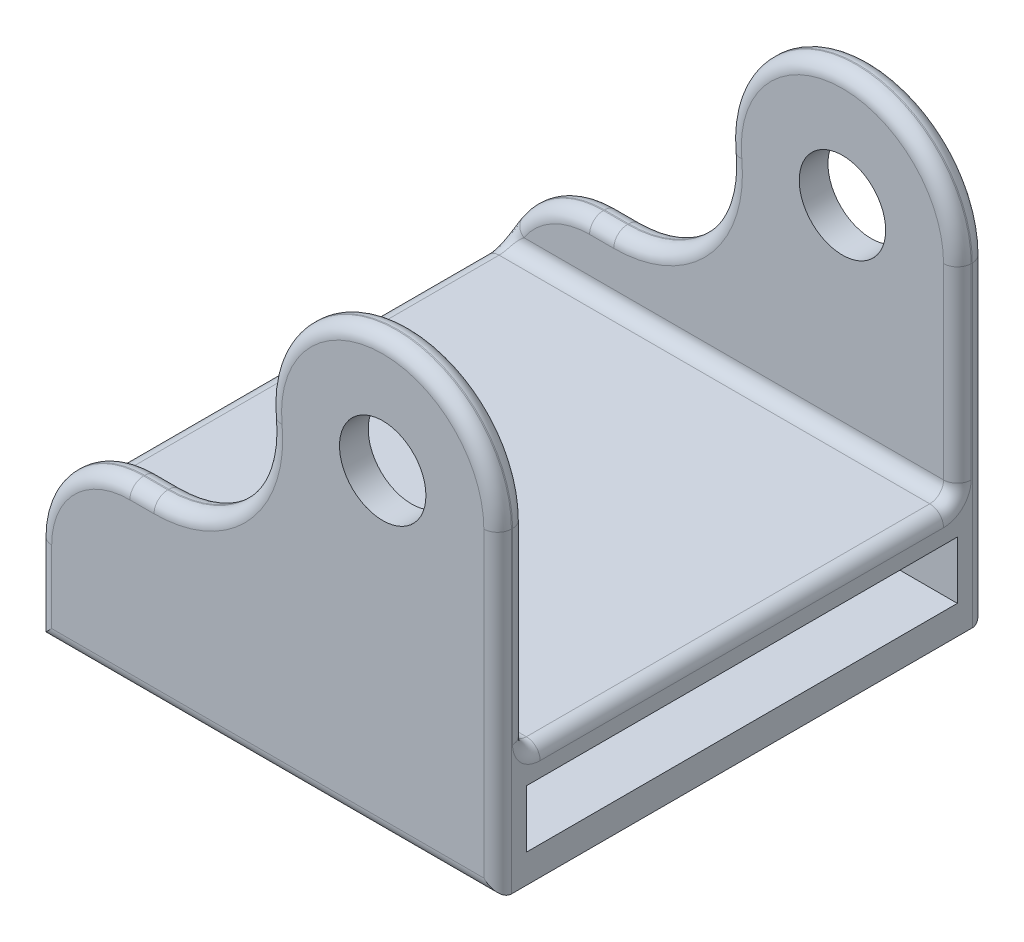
ISO-10303-21;
HEADER;
FILE_DESCRIPTION(('STEP AP214'),'2;1');
FILE_NAME('part.step','',(''),(''),'','','');
FILE_SCHEMA(('AUTOMOTIVE_DESIGN { 1 0 10303 214 1 1 1 1 }'));
ENDSEC;
DATA;
#1=APPLICATION_CONTEXT('core data for automotive mechanical design processes');
#2=APPLICATION_PROTOCOL_DEFINITION('international standard','automotive_design',2000,#1);
#3=PRODUCT_CONTEXT('',#1,'mechanical');
#4=PRODUCT('Part','Part','',(#3));
#5=PRODUCT_RELATED_PRODUCT_CATEGORY('part','',(#4));
#6=PRODUCT_DEFINITION_FORMATION('','',#4);
#7=PRODUCT_DEFINITION_CONTEXT('part definition',#1,'design');
#8=PRODUCT_DEFINITION('design','',#6,#7);
#9=PRODUCT_DEFINITION_SHAPE('','',#8);
#10=(LENGTH_UNIT() NAMED_UNIT(*) SI_UNIT(.MILLI.,.METRE.));
#11=(NAMED_UNIT(*) PLANE_ANGLE_UNIT() SI_UNIT($,.RADIAN.));
#12=(NAMED_UNIT(*) SI_UNIT($,.STERADIAN.) SOLID_ANGLE_UNIT());
#13=UNCERTAINTY_MEASURE_WITH_UNIT(LENGTH_MEASURE(1.E-05),#10,'distance_accuracy_value','');
#14=(GEOMETRIC_REPRESENTATION_CONTEXT(3) GLOBAL_UNCERTAINTY_ASSIGNED_CONTEXT((#13)) GLOBAL_UNIT_ASSIGNED_CONTEXT((#10,
#11,#12)) REPRESENTATION_CONTEXT('',''));
#15=CARTESIAN_POINT('',(0.,0.,0.));
#16=DIRECTION('',(0.,0.,1.));
#17=DIRECTION('',(1.,0.,0.));
#18=AXIS2_PLACEMENT_3D('',#15,#16,#17);
#19=CARTESIAN_POINT('',(0.,0.,13.49375));
#20=DIRECTION('',(-1.,0.,0.));
#21=DIRECTION('',(0.,0.,1.));
#22=AXIS2_PLACEMENT_3D('',#19,#20,#21);
#23=PLANE('',#22);
#24=DIRECTION('',(0.,0.,-1.));
#25=VECTOR('',#24,1.);
#26=CARTESIAN_POINT('',(0.,-3.175,11.90625));
#27=LINE('',#26,#25);
#28=CARTESIAN_POINT('',(0.,-3.175,11.90625));
#29=VERTEX_POINT('',#28);
#30=CARTESIAN_POINT('',(0.,-3.175,-11.90625));
#31=VERTEX_POINT('',#30);
#32=EDGE_CURVE('E288',#29,#31,#27,.T.);
#33=ORIENTED_EDGE('',*,*,#32,.F.);
#34=DIRECTION('',(0.,-1.,0.));
#35=VECTOR('',#34,1.);
#36=CARTESIAN_POINT('',(0.,0.,11.90625));
#37=LINE('',#36,#35);
#38=CARTESIAN_POINT('',(0.,0.,11.90625));
#39=VERTEX_POINT('',#38);
#40=EDGE_CURVE('E259',#39,#29,#37,.T.);
#41=ORIENTED_EDGE('',*,*,#40,.F.);
#42=DIRECTION('',(0.,0.,1.));
#43=VECTOR('',#42,1.);
#44=CARTESIAN_POINT('',(0.,0.,11.90625));
#45=LINE('',#44,#43);
#46=CARTESIAN_POINT('',(0.,0.,-11.90625));
#47=VERTEX_POINT('',#46);
#48=EDGE_CURVE('E279',#47,#39,#45,.T.);
#49=ORIENTED_EDGE('',*,*,#48,.F.);
#50=DIRECTION('',(0.,1.,0.));
#51=VECTOR('',#50,1.);
#52=CARTESIAN_POINT('',(0.,0.,-11.90625));
#53=LINE('',#52,#51);
#54=EDGE_CURVE('E282',#31,#47,#53,.T.);
#55=ORIENTED_EDGE('',*,*,#54,.F.);
#56=EDGE_LOOP('',(#33,#41,#49,#55));
#57=FACE_BOUND('',#56,.T.);
#58=DIRECTION('',(0.,0.,-1.));
#59=VECTOR('',#58,1.);
#60=CARTESIAN_POINT('',(0.,12.7,13.49375));
#61=LINE('',#60,#59);
#62=CARTESIAN_POINT('',(0.,12.7,12.73175));
#63=VERTEX_POINT('',#62);
#64=CARTESIAN_POINT('',(0.,12.7,12.66825));
#65=VERTEX_POINT('',#64);
#66=EDGE_CURVE('E331',#63,#65,#61,.T.);
#67=ORIENTED_EDGE('',*,*,#66,.F.);
#68=DIRECTION('',(0.,1.,0.));
#69=VECTOR('',#68,1.);
#70=CARTESIAN_POINT('',(0.,-4.7625,12.73175));
#71=LINE('',#70,#69);
#72=CARTESIAN_POINT('',(0.,-4.7625,12.73175));
#73=VERTEX_POINT('',#72);
#74=EDGE_CURVE('E350',#63,#73,#71,.F.);
#75=ORIENTED_EDGE('',*,*,#74,.T.);
#76=DIRECTION('',(0.,0.,1.));
#77=VECTOR('',#76,1.);
#78=CARTESIAN_POINT('',(0.,-4.7625,-13.49375));
#79=LINE('',#78,#77);
#80=CARTESIAN_POINT('',(0.,-4.7625,-12.73175));
#81=VERTEX_POINT('',#80);
#82=EDGE_CURVE('E301',#81,#73,#79,.T.);
#83=ORIENTED_EDGE('',*,*,#82,.F.);
#84=DIRECTION('',(0.,1.,0.));
#85=VECTOR('',#84,1.);
#86=CARTESIAN_POINT('',(0.,0.,-12.73175));
#87=LINE('',#86,#85);
#88=CARTESIAN_POINT('',(0.,12.7,-12.73175));
#89=VERTEX_POINT('',#88);
#90=EDGE_CURVE('E347',#81,#89,#87,.T.);
#91=ORIENTED_EDGE('',*,*,#90,.T.);
#92=CARTESIAN_POINT('',(0.,12.7,-12.66825));
#93=VERTEX_POINT('',#92);
#94=EDGE_CURVE('E328',#93,#89,#61,.T.);
#95=ORIENTED_EDGE('',*,*,#94,.F.);
#96=DIRECTION('',(0.,1.,0.));
#97=VECTOR('',#96,1.);
#98=CARTESIAN_POINT('',(0.,1.5875,-12.66825));
#99=LINE('',#98,#97);
#100=CARTESIAN_POINT('',(0.,2.3495,-12.66825));
#101=VERTEX_POINT('',#100);
#102=EDGE_CURVE('E342',#93,#101,#99,.F.);
#103=ORIENTED_EDGE('',*,*,#102,.T.);
#104=CARTESIAN_POINT('',(0.,2.3495,-11.14425));
#105=DIRECTION('',(-1.,0.,0.));
#106=DIRECTION('',(0.,0.,1.));
#107=AXIS2_PLACEMENT_3D('',#104,#105,#106);
#108=CIRCLE('',#107,1.524);
#109=CARTESIAN_POINT('',(0.,0.8255,-11.14425));
#110=VERTEX_POINT('',#109);
#111=EDGE_CURVE('E339',#110,#101,#108,.F.);
#112=ORIENTED_EDGE('',*,*,#111,.F.);
#113=DIRECTION('',(0.,0.,-1.));
#114=VECTOR('',#113,1.);
#115=CARTESIAN_POINT('',(0.,0.8255,11.90625));
#116=LINE('',#115,#114);
#117=CARTESIAN_POINT('',(0.,0.8255,11.14425));
#118=VERTEX_POINT('',#117);
#119=EDGE_CURVE('E337',#110,#118,#116,.F.);
#120=ORIENTED_EDGE('',*,*,#119,.T.);
#121=CARTESIAN_POINT('',(0.,2.3495,11.14425));
#122=DIRECTION('',(-1.,0.,0.));
#123=DIRECTION('',(0.,0.,1.));
#124=AXIS2_PLACEMENT_3D('',#121,#122,#123);
#125=CIRCLE('',#124,1.524);
#126=CARTESIAN_POINT('',(0.,2.3495,12.66825));
#127=VERTEX_POINT('',#126);
#128=EDGE_CURVE('E334',#127,#118,#125,.F.);
#129=ORIENTED_EDGE('',*,*,#128,.F.);
#130=DIRECTION('',(0.,1.,0.));
#131=VECTOR('',#130,1.);
#132=CARTESIAN_POINT('',(0.,0.,12.66825));
#133=LINE('',#132,#131);
#134=EDGE_CURVE('E344',#127,#65,#133,.T.);
#135=ORIENTED_EDGE('',*,*,#134,.T.);
#136=EDGE_LOOP('',(#67,#75,#83,#91,#95,#103,#112,#120,#129,#135));
#137=FACE_BOUND('',#136,.T.);
#138=ADVANCED_FACE('F32',(#57,#137),#23,.F.);
#139=CARTESIAN_POINT('',(-6.35,12.7,13.49375));
#140=DIRECTION('',(0.,0.,-1.));
#141=DIRECTION('',(-1.,0.,0.));
#142=AXIS2_PLACEMENT_3D('',#139,#140,#141);
#143=CYLINDRICAL_SURFACE('',#142,6.35);
#144=DIRECTION('',(0.,0.,-1.));
#145=VECTOR('',#144,1.);
#146=CARTESIAN_POINT('',(-12.668170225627,12.065,13.49375));
#147=LINE('',#146,#145);
#148=CARTESIAN_POINT('',(-12.668170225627,12.065,-12.66825));
#149=VERTEX_POINT('',#148);
#150=CARTESIAN_POINT('',(-12.668170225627,12.065,-12.73175));
#151=VERTEX_POINT('',#150);
#152=EDGE_CURVE('E324',#149,#151,#147,.T.);
#153=ORIENTED_EDGE('',*,*,#152,.F.);
#154=CARTESIAN_POINT('',(-6.35,12.7,-12.66825));
#155=DIRECTION('',(0.,0.,1.));
#156=DIRECTION('',(1.,0.,0.));
#157=AXIS2_PLACEMENT_3D('',#154,#155,#156);
#158=CIRCLE('',#157,6.35);
#159=EDGE_CURVE('E393',#149,#93,#158,.F.);
#160=ORIENTED_EDGE('',*,*,#159,.T.);
#161=ORIENTED_EDGE('',*,*,#94,.T.);
#162=CARTESIAN_POINT('',(-6.35,12.7,-12.73175));
#163=DIRECTION('',(0.,0.,1.));
#164=DIRECTION('',(1.,0.,0.));
#165=AXIS2_PLACEMENT_3D('',#162,#163,#164);
#166=CIRCLE('',#165,6.35);
#167=EDGE_CURVE('E391',#89,#151,#166,.T.);
#168=ORIENTED_EDGE('',*,*,#167,.T.);
#169=EDGE_LOOP('',(#153,#160,#161,#168));
#170=FACE_BOUND('',#169,.T.);
#171=ADVANCED_FACE('F583',(#170),#143,.T.);
#172=CARTESIAN_POINT('',(-18.9863404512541,11.43,13.49375));
#173=DIRECTION('',(0.,0.,-1.));
#174=DIRECTION('',(-1.,0.,0.));
#175=AXIS2_PLACEMENT_3D('',#172,#173,#174);
#176=CYLINDRICAL_SURFACE('',#175,6.35);
#177=DIRECTION('',(0.,0.,-1.));
#178=VECTOR('',#177,1.);
#179=CARTESIAN_POINT('',(-18.9863404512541,5.08,13.49375));
#180=LINE('',#179,#178);
#181=CARTESIAN_POINT('',(-18.9863404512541,5.08,-12.66825));
#182=VERTEX_POINT('',#181);
#183=CARTESIAN_POINT('',(-18.9863404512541,5.08,-12.73175));
#184=VERTEX_POINT('',#183);
#185=EDGE_CURVE('E320',#182,#184,#180,.T.);
#186=ORIENTED_EDGE('',*,*,#185,.F.);
#187=CARTESIAN_POINT('',(-18.9863404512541,11.43,-12.66825));
#188=DIRECTION('',(0.,0.,1.));
#189=DIRECTION('',(1.,0.,0.));
#190=AXIS2_PLACEMENT_3D('',#187,#188,#189);
#191=CIRCLE('',#190,6.35);
#192=EDGE_CURVE('E397',#182,#149,#191,.T.);
#193=ORIENTED_EDGE('',*,*,#192,.T.);
#194=ORIENTED_EDGE('',*,*,#152,.T.);
#195=CARTESIAN_POINT('',(-18.9863404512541,11.43,-12.73175));
#196=DIRECTION('',(0.,0.,1.));
#197=DIRECTION('',(1.,0.,0.));
#198=AXIS2_PLACEMENT_3D('',#195,#196,#197);
#199=CIRCLE('',#198,6.35);
#200=EDGE_CURVE('E395',#151,#184,#199,.F.);
#201=ORIENTED_EDGE('',*,*,#200,.T.);
#202=EDGE_LOOP('',(#186,#193,#194,#201));
#203=FACE_BOUND('',#202,.T.);
#204=ADVANCED_FACE('F588',(#203),#176,.F.);
#205=CARTESIAN_POINT('',(-18.9863404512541,5.08,13.49375));
#206=DIRECTION('',(0.,-1.,0.));
#207=DIRECTION('',(1.,0.,0.));
#208=AXIS2_PLACEMENT_3D('',#205,#206,#207);
#209=PLANE('',#208);
#210=DIRECTION('',(0.,0.,-1.));
#211=VECTOR('',#210,1.);
#212=CARTESIAN_POINT('',(-20.32,5.08,13.49375));
#213=LINE('',#212,#211);
#214=CARTESIAN_POINT('',(-20.32,5.08,-12.66825));
#215=VERTEX_POINT('',#214);
#216=CARTESIAN_POINT('',(-20.32,5.08,-12.73175));
#217=VERTEX_POINT('',#216);
#218=EDGE_CURVE('E316',#215,#217,#213,.T.);
#219=ORIENTED_EDGE('',*,*,#218,.F.);
#220=DIRECTION('',(-1.,0.,0.));
#221=VECTOR('',#220,1.);
#222=CARTESIAN_POINT('',(-18.9863404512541,5.08,-12.66825));
#223=LINE('',#222,#221);
#224=EDGE_CURVE('E401',#215,#182,#223,.F.);
#225=ORIENTED_EDGE('',*,*,#224,.T.);
#226=ORIENTED_EDGE('',*,*,#185,.T.);
#227=DIRECTION('',(-1.,0.,0.));
#228=VECTOR('',#227,1.);
#229=CARTESIAN_POINT('',(-18.9863404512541,5.08,-12.73175));
#230=LINE('',#229,#228);
#231=EDGE_CURVE('E399',#184,#217,#230,.T.);
#232=ORIENTED_EDGE('',*,*,#231,.T.);
#233=EDGE_LOOP('',(#219,#225,#226,#232));
#234=FACE_BOUND('',#233,.T.);
#235=ADVANCED_FACE('F461',(#234),#209,.F.);
#236=CARTESIAN_POINT('',(-20.32,0.,13.49375));
#237=DIRECTION('',(0.,0.,-1.));
#238=DIRECTION('',(-1.,0.,0.));
#239=AXIS2_PLACEMENT_3D('',#236,#237,#238);
#240=CYLINDRICAL_SURFACE('',#239,5.08);
#241=ORIENTED_EDGE('',*,*,#218,.T.);
#242=CARTESIAN_POINT('',(-20.32,0.,-12.73175));
#243=DIRECTION('',(0.,0.,1.));
#244=DIRECTION('',(1.,0.,0.));
#245=AXIS2_PLACEMENT_3D('',#242,#243,#244);
#246=CIRCLE('',#245,5.08);
#247=CARTESIAN_POINT('',(-25.4,0.,-12.73175));
#248=VERTEX_POINT('',#247);
#249=EDGE_CURVE('E698',#217,#248,#246,.T.);
#250=ORIENTED_EDGE('',*,*,#249,.T.);
#251=DIRECTION('',(0.,0.,-1.));
#252=VECTOR('',#251,1.);
#253=CARTESIAN_POINT('',(-25.4,0.,13.49375));
#254=LINE('',#253,#252);
#255=CARTESIAN_POINT('',(-25.4,0.,-11.90625));
#256=VERTEX_POINT('',#255);
#257=EDGE_CURVE('E314',#256,#248,#254,.T.);
#258=ORIENTED_EDGE('',*,*,#257,.F.);
#259=DIRECTION('',(0.,0.,1.));
#260=VECTOR('',#259,1.);
#261=CARTESIAN_POINT('',(-25.4,0.,11.90625));
#262=LINE('',#261,#260);
#263=CARTESIAN_POINT('',(-25.4,0.,11.90625));
#264=VERTEX_POINT('',#263);
#265=EDGE_CURVE('E264',#256,#264,#262,.T.);
#266=ORIENTED_EDGE('',*,*,#265,.T.);
#267=CARTESIAN_POINT('',(-25.4,0.,12.73175));
#268=VERTEX_POINT('',#267);
#269=EDGE_CURVE('E277',#268,#264,#254,.T.);
#270=ORIENTED_EDGE('',*,*,#269,.F.);
#271=CARTESIAN_POINT('',(-20.32,0.,12.73175));
#272=DIRECTION('',(0.,0.,1.));
#273=DIRECTION('',(1.,0.,0.));
#274=AXIS2_PLACEMENT_3D('',#271,#272,#273);
#275=CIRCLE('',#274,5.08);
#276=CARTESIAN_POINT('',(-20.32,5.08,12.73175));
#277=VERTEX_POINT('',#276);
#278=EDGE_CURVE('E437',#268,#277,#275,.F.);
#279=ORIENTED_EDGE('',*,*,#278,.T.);
#280=CARTESIAN_POINT('',(-20.32,5.08,12.66825));
#281=VERTEX_POINT('',#280);
#282=EDGE_CURVE('E319',#277,#281,#213,.T.);
#283=ORIENTED_EDGE('',*,*,#282,.T.);
#284=CARTESIAN_POINT('',(-20.32,0.,12.66825));
#285=DIRECTION('',(0.,0.,1.));
#286=DIRECTION('',(1.,0.,0.));
#287=AXIS2_PLACEMENT_3D('',#284,#285,#286);
#288=CIRCLE('',#287,5.08);
#289=CARTESIAN_POINT('',(-24.5821653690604,2.76411764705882,12.66825));
#290=VERTEX_POINT('',#289);
#291=EDGE_CURVE('E703',#281,#290,#288,.T.);
#292=ORIENTED_EDGE('',*,*,#291,.T.);
#293=CARTESIAN_POINT('',(-23.4713657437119,2.6507257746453,11.844183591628));
#294=CARTESIAN_POINT('',(-24.2334382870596,3.25302244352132,11.5849771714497));
#295=CARTESIAN_POINT('',(-24.0274891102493,3.472884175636,12.5441171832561));
#296=CARTESIAN_POINT('',(-23.5135259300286,2.62822038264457,11.8538605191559));
#297=CARTESIAN_POINT('',(-24.2599654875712,3.21852019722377,11.6223951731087));
#298=CARTESIAN_POINT('',(-24.0770893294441,3.41993031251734,12.5634710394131));
#299=CARTESIAN_POINT('',(-23.5551273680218,2.6050472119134,11.8625540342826));
#300=CARTESIAN_POINT('',(-24.2879734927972,3.18177434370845,11.6578281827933));
#301=CARTESIAN_POINT('',(-24.1260321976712,3.36540520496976,12.5808580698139));
#302=CARTESIAN_POINT('',(-23.6370130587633,2.55736728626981,11.8777803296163));
#303=CARTESIAN_POINT('',(-24.3451990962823,3.10533223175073,11.7229107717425));
#304=CARTESIAN_POINT('',(-24.2223683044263,3.25321714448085,12.611310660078));
#305=CARTESIAN_POINT('',(-23.6772947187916,2.53285813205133,11.8843090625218));
#306=CARTESIAN_POINT('',(-24.3744509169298,3.06562631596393,11.7527926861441));
#307=CARTESIAN_POINT('',(-24.2697584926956,3.19554854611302,12.6243681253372));
#308=CARTESIAN_POINT('',(-23.7960351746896,2.45719866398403,11.900362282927));
#309=CARTESIAN_POINT('',(-24.4620379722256,2.94382222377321,11.8326881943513));
#310=CARTESIAN_POINT('',(-24.4094531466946,3.01752626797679,12.6564745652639));
#311=CARTESIAN_POINT('',(-23.8719455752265,2.40415102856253,11.9062487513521));
#312=CARTESIAN_POINT('',(-24.5225587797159,2.85601147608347,11.8759116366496));
#313=CARTESIAN_POINT('',(-24.4987595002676,2.89270830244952,12.6682475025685));
#314=CARTESIAN_POINT('',(-23.9951766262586,2.30915554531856,11.9062509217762));
#315=CARTESIAN_POINT('',(-24.6246966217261,2.69854839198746,11.9278974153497));
#316=CARTESIAN_POINT('',(-24.6437372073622,2.66918951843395,12.6682518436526));
#317=CARTESIAN_POINT('',(-24.0447794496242,2.26793729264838,11.9030445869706));
#318=CARTESIAN_POINT('',(-24.6671021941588,2.63038097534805,11.9431677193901));
#319=CARTESIAN_POINT('',(-24.7020934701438,2.57220539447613,12.661839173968));
#320=CARTESIAN_POINT('',(-24.1373580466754,2.18493251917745,11.8894487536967));
#321=CARTESIAN_POINT('',(-24.7480507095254,2.49423856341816,11.9588461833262));
#322=CARTESIAN_POINT('',(-24.8110094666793,2.37690004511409,12.6346475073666));
#323=CARTESIAN_POINT('',(-24.1803532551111,2.14314807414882,11.8790808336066));
#324=CARTESIAN_POINT('',(-24.7869272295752,2.42585481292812,11.9596598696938));
#325=CARTESIAN_POINT('',(-24.8615920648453,2.2785837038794,12.613911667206));
#326=CARTESIAN_POINT('',(-24.259282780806,2.06014359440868,11.8505469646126));
#327=CARTESIAN_POINT('',(-24.8599120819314,2.29181350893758,11.9466505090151));
#328=CARTESIAN_POINT('',(-24.9544503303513,2.08327904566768,12.5568439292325));
#329=CARTESIAN_POINT('',(-24.2951640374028,2.01892978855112,11.8323254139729));
#330=CARTESIAN_POINT('',(-24.8942895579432,2.22570879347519,11.9329005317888));
#331=CARTESIAN_POINT('',(-24.9966635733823,1.98630538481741,12.5204008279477));
#332=CARTESIAN_POINT('',(-24.3591302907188,1.93926396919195,11.7880087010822));
#333=CARTESIAN_POINT('',(-24.9571607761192,2.10017395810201,11.8918253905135));
#334=CARTESIAN_POINT('',(-25.0719179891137,1.79885639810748,12.4317674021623));
#335=CARTESIAN_POINT('',(-24.3872134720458,1.90081260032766,11.7619117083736));
#336=CARTESIAN_POINT('',(-24.9858830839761,2.0403310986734,11.8645007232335));
#337=CARTESIAN_POINT('',(-25.1049570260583,1.70838258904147,12.3795734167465));
#338=CARTESIAN_POINT('',(-24.4333735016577,1.83239155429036,11.7055017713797));
#339=CARTESIAN_POINT('',(-25.0345656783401,1.93596370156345,11.8020239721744));
#340=CARTESIAN_POINT('',(-25.1592629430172,1.54739189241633,12.2667535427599));
#341=CARTESIAN_POINT('',(-24.452183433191,1.80195614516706,11.6759007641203));
#342=CARTESIAN_POINT('',(-25.0552213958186,1.89029733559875,11.7679001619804));
#343=CARTESIAN_POINT('',(-25.1813922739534,1.4757791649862,12.2075515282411));
#344=CARTESIAN_POINT('',(-24.48442710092,1.74616281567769,11.6116231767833));
#345=CARTESIAN_POINT('',(-25.0917640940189,1.80811998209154,11.6927650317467));
#346=CARTESIAN_POINT('',(-25.2193260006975,1.34450074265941,12.0789963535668));
#347=CARTESIAN_POINT('',(-24.4978623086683,1.72080350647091,11.576947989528));
#348=CARTESIAN_POINT('',(-25.1076981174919,1.77150416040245,11.6516671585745));
#349=CARTESIAN_POINT('',(-25.2351321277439,1.28483177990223,12.009645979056));
#350=CARTESIAN_POINT('',(-24.519737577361,1.67706651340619,11.5050503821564));
#351=CARTESIAN_POINT('',(-25.1344863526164,1.7094082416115,11.5665113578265));
#352=CARTESIAN_POINT('',(-25.2608677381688,1.18192120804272,11.8658507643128));
#353=CARTESIAN_POINT('',(-24.5283576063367,1.65844804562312,11.4679875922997));
#354=CARTESIAN_POINT('',(-25.1455285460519,1.68351690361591,11.5225881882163));
#355=CARTESIAN_POINT('',(-25.2710089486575,1.13811304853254,11.7917251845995));
#356=CARTESIAN_POINT('',(-24.5421371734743,1.62743512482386,11.3911934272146));
#357=CARTESIAN_POINT('',(-25.1636493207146,1.64090994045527,11.4320484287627));
#358=CARTESIAN_POINT('',(-25.2872202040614,1.06514147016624,11.6381368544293));
#359=CARTESIAN_POINT('',(-24.5472967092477,1.61504067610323,11.3514620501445));
#360=CARTESIAN_POINT('',(-25.170720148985,1.62421227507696,11.3854284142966));
#361=CARTESIAN_POINT('',(-25.2932902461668,1.03597806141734,11.5586741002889));
#362=CARTESIAN_POINT('',(-24.554721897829,1.59683064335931,11.2702410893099));
#363=CARTESIAN_POINT('',(-25.1810489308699,1.59981780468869,11.2905510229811));
#364=CARTESIAN_POINT('',(-25.3020257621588,0.993130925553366,11.3962321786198));
#365=CARTESIAN_POINT('',(-24.5569725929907,1.59104908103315,11.2287435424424));
#366=CARTESIAN_POINT('',(-25.1842771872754,1.59219110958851,11.2423246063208));
#367=CARTESIAN_POINT('',(-25.3046736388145,0.979527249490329,11.3132370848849));
#368=CARTESIAN_POINT('',(-24.5588040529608,1.58635584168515,11.1453392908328));
#369=CARTESIAN_POINT('',(-25.1869025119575,1.58598594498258,11.145488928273));
#370=CARTESIAN_POINT('',(-25.306828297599,0.96848433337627,11.1464285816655));
#371=CARTESIAN_POINT('',(-24.5583843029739,1.58744548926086,11.103432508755));
#372=CARTESIAN_POINT('',(-25.1862956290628,1.58741681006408,11.096939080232));
#373=CARTESIAN_POINT('',(-25.3063344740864,0.971048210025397,11.0626150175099));
#374=CARTESIAN_POINT('',(-24.5548248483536,1.59650389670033,11.0201504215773));
#375=CARTESIAN_POINT('',(-25.1812183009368,1.59942080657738,11.0001049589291));
#376=CARTESIAN_POINT('',(-25.3021468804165,0.992362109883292,10.8960508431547));
#377=CARTESIAN_POINT('',(-24.5516693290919,1.60451265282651,10.9787796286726));
#378=CARTESIAN_POINT('',(-25.1767314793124,1.61003269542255,10.9518807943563));
#379=CARTESIAN_POINT('',(-25.2984345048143,1.01120624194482,10.8133092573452));
#380=CARTESIAN_POINT('',(-24.5421779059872,1.62716684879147,10.8979600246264));
#381=CARTESIAN_POINT('',(-25.1637629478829,1.64061424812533,10.8572558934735));
#382=CARTESIAN_POINT('',(-25.2872681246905,1.06451023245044,10.6516700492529));
#383=CARTESIAN_POINT('',(-24.5358395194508,1.64181746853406,10.8585127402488));
#384=CARTESIAN_POINT('',(-25.1552883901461,1.66056710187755,10.8108799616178));
#385=CARTESIAN_POINT('',(-25.2798111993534,1.0989822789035,10.5727754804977));
#386=CARTESIAN_POINT('',(-24.5276920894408,1.65963433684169,10.8206308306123));
#387=CARTESIAN_POINT('',(-25.1447595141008,1.68528598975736,10.7659486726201));
#388=CARTESIAN_POINT('',(-25.2702259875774,1.14090432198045,10.4970116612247));
#389=(BOUNDED_SURFACE() B_SPLINE_SURFACE(3,2,((#293,#294,#295),(#296,#297,#298),(#299,#300,
#301),(#302,#303,#304),(#305,#306,#307),(#308,#309,#310),(#311,#312,#313),(#314,#315,#316),
(#317,#318,#319),(#320,#321,#322),(#323,#324,#325),(#326,#327,#328),(#329,#330,#331),(#332,#333,
#334),(#335,#336,#337),(#338,#339,#340),(#341,#342,#343),(#344,#345,#346),(#347,#348,#349),
(#350,#351,#352),(#353,#354,#355),(#356,#357,#358),(#359,#360,#361),(#362,#363,#364),(#365,#366,
#367),(#368,#369,#370),(#371,#372,#373),(#374,#375,#376),(#377,#378,#379),(#380,#381,#382),
(#383,#384,#385),(#386,#387,#388)),.UNSPECIFIED.,.F.,.F.,.F.) B_SPLINE_SURFACE_WITH_KNOTS((4,2,
2,2,2,2,2,2,2,2,2,2,2,2,2,4),(3,3),(0.,0.193803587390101,0.387967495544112,0.778308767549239,
1.06646630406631,1.35375936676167,1.64312069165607,1.93254932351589,2.19214173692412,
2.45166302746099,2.70069351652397,2.9497241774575,3.20003035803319,3.45038479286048,
3.70219617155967,3.95420427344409),(0.,1.),
.UNSPECIFIED.) GEOMETRIC_REPRESENTATION_ITEM() RATIONAL_B_SPLINE_SURFACE(((1.,0.604049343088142,
1.),(1.,0.614109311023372,1.),(1.,0.623837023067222,1.),(1.,0.64258457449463,1.),(1.,
0.651603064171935,1.),(1.,0.677564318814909,1.),(1.,0.693307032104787,1.),(1.,0.71729402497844,
1.),(1.,0.726422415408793,1.),(1.,0.74236667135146,1.),(1.,0.749189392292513,1.),(1.,
0.760541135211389,1.),(1.,0.765053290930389,1.),(1.,0.771889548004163,1.),(1.,0.774213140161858,
1.),(1.,0.776966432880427,1.),(1.,0.777566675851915,1.),(1.,0.777827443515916,1.),(1.,
0.777488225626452,1.),(1.,0.776400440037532,1.),(1.,0.775668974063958,1.),(1.,0.77421990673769,
1.),(1.,0.773502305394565,1.),(1.,0.772384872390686,1.),(1.,0.771986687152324,1.),(1.,
0.77166538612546,1.),(1.,0.771742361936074,1.),(1.,0.772352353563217,1.),(1.,0.772888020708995,
1.),(1.,0.774176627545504,1.),(1.,0.774929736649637,1.),(1.,0.775669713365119,1.))) REPRESENTATION_ITEM('') SURFACE());
#390=CARTESIAN_POINT('',(-25.2702259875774,1.14090432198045,10.4970116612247));
#391=CARTESIAN_POINT('',(-25.2798111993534,1.0989822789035,10.5727754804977));
#392=CARTESIAN_POINT('',(-25.2872681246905,1.06451023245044,10.6516700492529));
#393=CARTESIAN_POINT('',(-25.2984345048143,1.01120624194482,10.8133092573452));
#394=CARTESIAN_POINT('',(-25.3021468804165,0.992362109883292,10.8960508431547));
#395=CARTESIAN_POINT('',(-25.3063344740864,0.971048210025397,11.0626150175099));
#396=CARTESIAN_POINT('',(-25.306828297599,0.96848433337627,11.1464285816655));
#397=CARTESIAN_POINT('',(-25.3046736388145,0.979527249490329,11.3132370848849));
#398=CARTESIAN_POINT('',(-25.3020257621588,0.993130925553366,11.3962321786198));
#399=CARTESIAN_POINT('',(-25.2932902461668,1.03597806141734,11.5586741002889));
#400=CARTESIAN_POINT('',(-25.2872202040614,1.06514147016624,11.6381368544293));
#401=CARTESIAN_POINT('',(-25.2710089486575,1.13811304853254,11.7917251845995));
#402=CARTESIAN_POINT('',(-25.2608677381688,1.18192120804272,11.8658507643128));
#403=CARTESIAN_POINT('',(-25.2351321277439,1.28483177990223,12.009645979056));
#404=CARTESIAN_POINT('',(-25.2193260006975,1.34450074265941,12.0789963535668));
#405=CARTESIAN_POINT('',(-25.1813922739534,1.4757791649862,12.2075515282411));
#406=CARTESIAN_POINT('',(-25.1592629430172,1.54739189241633,12.2667535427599));
#407=CARTESIAN_POINT('',(-25.1049570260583,1.70838258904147,12.3795734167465));
#408=CARTESIAN_POINT('',(-25.0719179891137,1.79885639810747,12.4317674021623));
#409=CARTESIAN_POINT('',(-24.9966635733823,1.98630538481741,12.5204008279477));
#410=CARTESIAN_POINT('',(-24.9544503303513,2.08327904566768,12.5568439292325));
#411=CARTESIAN_POINT('',(-24.8615920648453,2.2785837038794,12.613911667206));
#412=CARTESIAN_POINT('',(-24.8110094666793,2.37690004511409,12.6346475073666));
#413=CARTESIAN_POINT('',(-24.7020934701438,2.57220539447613,12.661839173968));
#414=CARTESIAN_POINT('',(-24.6437372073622,2.66918951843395,12.6682518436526));
#415=CARTESIAN_POINT('',(-24.4987595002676,2.89270830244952,12.6682475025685));
#416=CARTESIAN_POINT('',(-24.4094531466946,3.01752626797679,12.6564745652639));
#417=CARTESIAN_POINT('',(-24.2697584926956,3.19554854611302,12.6243681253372));
#418=CARTESIAN_POINT('',(-24.2223683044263,3.25321714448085,12.611310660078));
#419=CARTESIAN_POINT('',(-24.1260321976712,3.36540520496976,12.5808580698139));
#420=CARTESIAN_POINT('',(-24.0770893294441,3.41993031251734,12.5634710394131));
#421=CARTESIAN_POINT('',(-24.0274891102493,3.472884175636,12.5441171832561));
#422=B_SPLINE_CURVE_WITH_KNOTS('',3,(#390,#391,#392,#393,#394,#395,#396,#397,#398,#399,#400,
#401,#402,#403,#404,#405,#406,#407,#408,#409,#410,#411,#412,#413,#414,#415,#416,#417,#418,#419,
#420,#421),.UNSPECIFIED.,.F.,.F.,(4,2,2,2,2,2,2,2,2,2,2,2,2,2,2,4),(0.,0.252008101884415,
0.503819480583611,0.754173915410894,1.00448009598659,1.25351075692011,1.50254124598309,
1.76206253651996,2.02165494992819,2.31108358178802,2.60044490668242,2.88773796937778,
3.17589550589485,3.56623677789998,3.76040068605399,3.95420427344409),.UNSPECIFIED.);
#423=CARTESIAN_POINT('',(-25.3063028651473,0.971176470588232,11.14425));
#424=VERTEX_POINT('',#423);
#425=EDGE_CURVE('E707',#424,#290,#422,.T.);
#426=ORIENTED_EDGE('',*,*,#425,.F.);
#427=DIRECTION('',(0.,0.,-1.));
#428=VECTOR('',#427,1.);
#429=CARTESIAN_POINT('',(-25.3063028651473,0.971176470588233,13.49375));
#430=LINE('',#429,#428);
#431=CARTESIAN_POINT('',(-25.3063028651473,0.971176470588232,-11.14425));
#432=VERTEX_POINT('',#431);
#433=EDGE_CURVE('E449',#424,#432,#430,.T.);
#434=ORIENTED_EDGE('',*,*,#433,.T.);
#435=CARTESIAN_POINT('',(-24.5414297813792,1.62880247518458,-10.8967846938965));
#436=CARTESIAN_POINT('',(-25.1627939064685,1.64289995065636,-10.8557283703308));
#437=CARTESIAN_POINT('',(-25.2863879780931,1.06835876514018,-10.6493193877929));
#438=CARTESIAN_POINT('',(-24.5472358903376,1.61513815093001,-10.936456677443));
#439=CARTESIAN_POINT('',(-25.1706532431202,1.62436023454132,-10.9024813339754));
#440=CARTESIAN_POINT('',(-25.2932186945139,1.03620741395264,-10.7286633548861));
#441=CARTESIAN_POINT('',(-24.551470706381,1.60481166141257,-10.977318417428));
#442=CARTESIAN_POINT('',(-25.1765199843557,1.61051173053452,-10.9501997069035));
#443=CARTESIAN_POINT('',(-25.298200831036,1.01190979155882,-10.810386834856));
#444=CARTESIAN_POINT('',(-24.557032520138,1.59099633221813,-11.0602038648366));
#445=CARTESIAN_POINT('',(-25.1843278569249,1.59207431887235,-11.0467186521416));
#446=CARTESIAN_POINT('',(-25.3047441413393,0.979403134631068,-10.9761577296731));
#447=CARTESIAN_POINT('',(-24.5583614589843,1.58750292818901,-11.1022267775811));
#448=CARTESIAN_POINT('',(-25.1862634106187,1.58749857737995,-11.0954734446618));
#449=CARTESIAN_POINT('',(-25.3063075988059,0.971183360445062,-11.0602035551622));
#450=CARTESIAN_POINT('',(-24.558353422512,1.58749707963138,-11.1861609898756));
#451=CARTESIAN_POINT('',(-25.1862610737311,1.58750141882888,-11.1928965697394));
#452=CARTESIAN_POINT('',(-25.3062981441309,0.971169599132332,-11.2280719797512));
#453=CARTESIAN_POINT('',(-24.5570235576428,1.59096601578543,-11.2280722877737));
#454=CARTESIAN_POINT('',(-25.1843334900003,1.59205564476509,-11.2415018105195));
#455=CARTESIAN_POINT('',(-25.3047335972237,0.979331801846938,-11.3118945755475));
#456=CARTESIAN_POINT('',(-24.5515263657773,1.60472518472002,-11.310704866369));
#457=CARTESIAN_POINT('',(-25.1765802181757,1.61037480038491,-11.3377630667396));
#458=CARTESIAN_POINT('',(-25.2982663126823,1.01170631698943,-11.4771597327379));
#459=CARTESIAN_POINT('',(-24.547359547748,1.61501419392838,-11.3514263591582));
#460=CARTESIAN_POINT('',(-25.1707636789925,1.62411811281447,-11.3853711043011));
#461=CARTESIAN_POINT('',(-25.2933641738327,1.03591575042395,-11.5586027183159));
#462=CARTESIAN_POINT('',(-24.5357152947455,1.64209023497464,-11.4305441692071));
#463=CARTESIAN_POINT('',(-25.1551275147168,1.66096689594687,-11.4783706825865));
#464=CARTESIAN_POINT('',(-25.2796650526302,1.09962408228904,-11.7168383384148));
#465=CARTESIAN_POINT('',(-24.5282365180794,1.65887989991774,-11.4689395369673));
#466=CARTESIAN_POINT('',(-25.1453162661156,1.68405272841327,-11.5237494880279));
#467=CARTESIAN_POINT('',(-25.2708664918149,1.13912917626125,-11.7936290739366));
#468=CARTESIAN_POINT('',(-24.5092713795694,1.69838459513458,-11.5422788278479));
#469=CARTESIAN_POINT('',(-25.1215305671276,1.73952034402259,-11.6105849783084));
#470=CARTESIAN_POINT('',(-25.2485545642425,1.23208140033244,-11.9403076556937));
#471=CARTESIAN_POINT('',(-24.4977853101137,1.72109919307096,-11.5772230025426));
#472=CARTESIAN_POINT('',(-25.1075553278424,1.77190468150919,-11.6520776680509));
#473=CARTESIAN_POINT('',(-25.2350415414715,1.28552751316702,-12.0101960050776));
#474=CARTESIAN_POINT('',(-24.4701220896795,1.77147282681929,-11.6424631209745));
#475=CARTESIAN_POINT('',(-25.075371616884,1.84517636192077,-11.7289237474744));
#476=CARTESIAN_POINT('',(-25.2024965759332,1.40405371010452,-12.1406762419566));
#477=CARTESIAN_POINT('',(-24.4539744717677,1.79910032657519,-11.6727865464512));
#478=CARTESIAN_POINT('',(-25.0571623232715,1.88607303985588,-11.7643859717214));
#479=CARTESIAN_POINT('',(-25.1834993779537,1.46905959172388,-12.2013230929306));
#480=CARTESIAN_POINT('',(-24.4163111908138,1.85834595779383,-11.7282519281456));
#481=CARTESIAN_POINT('',(-25.016383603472,1.97527841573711,-11.8275273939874));
#482=CARTESIAN_POINT('',(-25.1391896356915,1.60846107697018,-12.312253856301));
#483=CARTESIAN_POINT('',(-24.3947957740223,1.88996390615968,-11.7533941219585));
#484=CARTESIAN_POINT('',(-24.9937455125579,2.02373318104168,-11.8552846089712));
#485=CARTESIAN_POINT('',(-25.1138773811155,1.68285624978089,-12.3625382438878));
#486=CARTESIAN_POINT('',(-24.3460204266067,1.95597126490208,-11.7979821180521));
#487=CARTESIAN_POINT('',(-24.9442329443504,2.12622624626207,-11.9013955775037));
#488=CARTESIAN_POINT('',(-25.0564946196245,1.83816768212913,-12.4517142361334));
#489=CARTESIAN_POINT('',(-24.3187608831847,1.99036048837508,-11.8174283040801));
#490=CARTESIAN_POINT('',(-24.9172396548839,2.18049337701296,-11.9197882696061));
#491=CARTESIAN_POINT('',(-25.0244245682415,1.91908350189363,-12.4906066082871));
#492=CARTESIAN_POINT('',(-24.2585056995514,2.06063115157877,-11.8504415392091));
#493=CARTESIAN_POINT('',(-24.8594357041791,2.29239259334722,-11.9461553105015));
#494=CARTESIAN_POINT('',(-24.9535361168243,2.08442623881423,-12.5566330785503));
#495=CARTESIAN_POINT('',(-24.2255121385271,2.09651204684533,-11.8640107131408));
#496=CARTESIAN_POINT('',(-24.8284593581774,2.35030770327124,-11.9540912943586));
#497=CARTESIAN_POINT('',(-24.9147201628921,2.16885187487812,-12.5837714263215));
#498=CARTESIAN_POINT('',(-24.1523334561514,2.17042484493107,-11.8859615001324));
#499=CARTESIAN_POINT('',(-24.7617094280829,2.47027626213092,-11.9593364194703));
#500=CARTESIAN_POINT('',(-24.8286275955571,2.34276434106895,-12.6276730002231));
#501=CARTESIAN_POINT('',(-24.1118711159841,2.20847454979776,-11.8940496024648));
#502=CARTESIAN_POINT('',(-24.7255706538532,2.53268154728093,-11.9559269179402));
#503=CARTESIAN_POINT('',(-24.7810248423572,2.43229305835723,-12.6438492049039));
#504=CARTESIAN_POINT('',(-24.0256173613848,2.28393017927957,-11.9043823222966));
#505=CARTESIAN_POINT('',(-24.6508265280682,2.65663449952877,-11.9374913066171));
#506=CARTESIAN_POINT('',(-24.6795498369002,2.60983571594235,-12.664514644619));
#507=CARTESIAN_POINT('',(-23.9798127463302,2.32133423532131,-11.9066121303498));
#508=CARTESIAN_POINT('',(-24.6119697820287,2.7184807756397,-11.92214001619));
#509=CARTESIAN_POINT('',(-24.625662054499,2.6978452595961,-12.6689742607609));
#510=CARTESIAN_POINT('',(-23.8647635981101,2.40911820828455,-11.9056316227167));
#511=CARTESIAN_POINT('',(-24.5170166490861,2.86401244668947,-11.8718246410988));
#512=CARTESIAN_POINT('',(-24.4903101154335,2.90439578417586,-12.6670132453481));
#513=CARTESIAN_POINT('',(-23.7934043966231,2.45879095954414,-11.8999260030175));
#514=CARTESIAN_POINT('',(-24.4603171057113,2.94615297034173,-11.8308963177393));
#515=CARTESIAN_POINT('',(-24.4063581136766,3.02127284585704,-12.6556020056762));
#516=CARTESIAN_POINT('',(-23.6820058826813,2.52989655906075,-11.8849844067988));
#517=CARTESIAN_POINT('',(-24.3779869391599,3.0607406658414,-11.7561284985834));
#518=CARTESIAN_POINT('',(-24.2753010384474,3.1885801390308,-12.6257188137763));
#519=CARTESIAN_POINT('',(-23.6442228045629,2.5529902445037,-11.8789575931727));
#520=CARTESIAN_POINT('',(-24.3504693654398,3.09818036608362,-11.7283241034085));
#521=CARTESIAN_POINT('',(-24.2308503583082,3.2429182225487,-12.6136651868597));
#522=CARTESIAN_POINT('',(-23.5674590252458,2.59800462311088,-11.8649724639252));
#523=CARTESIAN_POINT('',(-24.2965024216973,3.17046994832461,-11.6679874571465));
#524=CARTESIAN_POINT('',(-24.1405400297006,3.34883440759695,-12.58569492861));
#525=CARTESIAN_POINT('',(-23.5284803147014,2.61992711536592,-11.8570172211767));
#526=CARTESIAN_POINT('',(-24.2700227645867,3.2053294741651,-11.6352633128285));
#527=CARTESIAN_POINT('',(-24.0946827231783,3.40041674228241,-12.5697844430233));
#528=CARTESIAN_POINT('',(-23.4889891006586,2.64126219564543,-11.8481809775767));
#529=CARTESIAN_POINT('',(-24.2447916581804,3.23823355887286,-11.6007509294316));
#530=CARTESIAN_POINT('',(-24.048222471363,3.45061693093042,-12.5521119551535));
#531=(BOUNDED_SURFACE() B_SPLINE_SURFACE(3,2,((#435,#436,#437),(#438,#439,#440),(#441,#442,
#443),(#444,#445,#446),(#447,#448,#449),(#450,#451,#452),(#453,#454,#455),(#456,#457,#458),
(#459,#460,#461),(#462,#463,#464),(#465,#466,#467),(#468,#469,#470),(#471,#472,#473),(#474,#475,
#476),(#477,#478,#479),(#480,#481,#482),(#483,#484,#485),(#486,#487,#488),(#489,#490,#491),
(#492,#493,#494),(#495,#496,#497),(#498,#499,#500),(#501,#502,#503),(#504,#505,#506),(#507,#508,
#509),(#510,#511,#512),(#513,#514,#515),(#516,#517,#518),(#519,#520,#521),(#522,#523,#524),
(#525,#526,#527),(#528,#529,#530)),.UNSPECIFIED.,.F.,.F.,.F.) B_SPLINE_SURFACE_WITH_KNOTS((4,2,
2,2,2,2,2,2,2,2,2,2,2,2,2,4),(3,3),(0.,0.252012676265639,0.503856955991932,0.755028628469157,
1.00615525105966,1.2573836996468,1.50859382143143,1.75824608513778,2.00788689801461,
2.2575108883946,2.50704455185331,2.76906289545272,3.03174297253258,3.39812876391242,
3.58062510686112,3.7628325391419),(0.,1.),
.UNSPECIFIED.) GEOMETRIC_REPRESENTATION_ITEM() RATIONAL_B_SPLINE_SURFACE(((1.,0.774244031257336,
1.),(1.,0.773500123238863,1.),(1.,0.772875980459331,1.),(1.,0.771998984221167,1.),(1.,
0.771745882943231,1.),(1.,0.771741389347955,1.),(1.,0.7719886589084,1.),(1.,0.772878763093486,
1.),(1.,0.77352152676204,1.),(1.,0.77494031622,1.),(1.,0.775716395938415,1.),(1.,
0.777006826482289,1.),(1.,0.777521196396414,1.),(1.,0.777830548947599,1.),(1.,0.777629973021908,
1.),(1.,0.776085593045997,1.),(1.,0.774741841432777,1.),(1.,0.77056516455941,1.),(1.,
0.767732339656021,1.),(1.,0.760370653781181,1.),(1.,0.755842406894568,1.),(1.,0.74475297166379,
1.),(1.,0.738101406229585,1.),(1.,0.722908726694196,1.),(1.,0.714362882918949,1.),(1.,
0.691807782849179,1.),(1.,0.676973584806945,1.),(1.,0.652640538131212,1.),(1.,0.644200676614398,
1.),(1.,0.626686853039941,1.),(1.,0.617613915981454,1.),(1.,0.608243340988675,1.))) REPRESENTATION_ITEM('') SURFACE());
#532=CARTESIAN_POINT('',(-24.048222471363,3.45061693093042,-12.5521119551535));
#533=CARTESIAN_POINT('',(-24.0946827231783,3.40041674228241,-12.5697844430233));
#534=CARTESIAN_POINT('',(-24.1405400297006,3.34883440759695,-12.58569492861));
#535=CARTESIAN_POINT('',(-24.2308503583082,3.2429182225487,-12.6136651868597));
#536=CARTESIAN_POINT('',(-24.2753010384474,3.1885801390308,-12.6257188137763));
#537=CARTESIAN_POINT('',(-24.4063581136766,3.02127284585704,-12.6556020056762));
#538=CARTESIAN_POINT('',(-24.4903101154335,2.90439578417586,-12.6670132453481));
#539=CARTESIAN_POINT('',(-24.625662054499,2.6978452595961,-12.6689742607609));
#540=CARTESIAN_POINT('',(-24.6795498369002,2.60983571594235,-12.664514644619));
#541=CARTESIAN_POINT('',(-24.7810248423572,2.43229305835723,-12.6438492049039));
#542=CARTESIAN_POINT('',(-24.8286275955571,2.34276434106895,-12.6276730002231));
#543=CARTESIAN_POINT('',(-24.9147201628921,2.16885187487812,-12.5837714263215));
#544=CARTESIAN_POINT('',(-24.9535361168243,2.08442623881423,-12.5566330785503));
#545=CARTESIAN_POINT('',(-25.0244245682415,1.91908350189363,-12.4906066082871));
#546=CARTESIAN_POINT('',(-25.0564946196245,1.83816768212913,-12.4517142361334));
#547=CARTESIAN_POINT('',(-25.1138773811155,1.68285624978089,-12.3625382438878));
#548=CARTESIAN_POINT('',(-25.1391896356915,1.60846107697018,-12.312253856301));
#549=CARTESIAN_POINT('',(-25.1834993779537,1.46905959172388,-12.2013230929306));
#550=CARTESIAN_POINT('',(-25.2024965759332,1.40405371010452,-12.1406762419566));
#551=CARTESIAN_POINT('',(-25.2350415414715,1.28552751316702,-12.0101960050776));
#552=CARTESIAN_POINT('',(-25.2485545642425,1.23208140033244,-11.9403076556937));
#553=CARTESIAN_POINT('',(-25.2708664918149,1.13912917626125,-11.7936290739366));
#554=CARTESIAN_POINT('',(-25.2796650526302,1.09962408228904,-11.7168383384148));
#555=CARTESIAN_POINT('',(-25.2933641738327,1.03591575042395,-11.5586027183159));
#556=CARTESIAN_POINT('',(-25.2982663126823,1.01170631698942,-11.4771597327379));
#557=CARTESIAN_POINT('',(-25.3047335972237,0.979331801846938,-11.3118945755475));
#558=CARTESIAN_POINT('',(-25.3062981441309,0.971169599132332,-11.2280719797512));
#559=CARTESIAN_POINT('',(-25.3063075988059,0.971183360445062,-11.0602035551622));
#560=CARTESIAN_POINT('',(-25.3047441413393,0.979403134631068,-10.9761577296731));
#561=CARTESIAN_POINT('',(-25.298200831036,1.01190979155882,-10.810386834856));
#562=CARTESIAN_POINT('',(-25.2932186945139,1.03620741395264,-10.7286633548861));
#563=CARTESIAN_POINT('',(-25.2863879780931,1.06835876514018,-10.6493193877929));
#564=B_SPLINE_CURVE_WITH_KNOTS('',3,(#532,#533,#534,#535,#536,#537,#538,#539,#540,#541,#542,
#543,#544,#545,#546,#547,#548,#549,#550,#551,#552,#553,#554,#555,#556,#557,#558,#559,#560,#561,
#562,#563),.UNSPECIFIED.,.F.,.F.,(4,2,2,2,2,2,2,2,2,2,2,2,2,2,2,4),(0.,0.182207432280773,
0.364703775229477,0.731089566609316,0.993769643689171,1.25578798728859,1.50532165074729,
1.75494564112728,2.00458645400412,2.25423871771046,2.50544883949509,2.75667728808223,
3.00780391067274,3.25897558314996,3.51081986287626,3.7628325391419),.UNSPECIFIED.);
#565=CARTESIAN_POINT('',(-24.5821653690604,2.76411764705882,-12.66825));
#566=VERTEX_POINT('',#565);
#567=EDGE_CURVE('E441',#566,#432,#564,.T.);
#568=ORIENTED_EDGE('',*,*,#567,.F.);
#569=CARTESIAN_POINT('',(-20.32,0.,-12.66825));
#570=DIRECTION('',(0.,0.,1.));
#571=DIRECTION('',(1.,0.,0.));
#572=AXIS2_PLACEMENT_3D('',#569,#570,#571);
#573=CIRCLE('',#572,5.08);
#574=EDGE_CURVE('E439',#566,#215,#573,.F.);
#575=ORIENTED_EDGE('',*,*,#574,.T.);
#576=EDGE_LOOP('',(#241,#250,#258,#266,#270,#279,#283,#292,#426,#434,#568,#575));
#577=FACE_BOUND('',#576,.T.);
#578=ADVANCED_FACE('F455',(#577),#240,.T.);
#579=ORIENTED_EDGE('',*,*,#66,.T.);
#580=CARTESIAN_POINT('',(-6.35,12.7,12.66825));
#581=DIRECTION('',(0.,0.,1.));
#582=DIRECTION('',(1.,0.,0.));
#583=AXIS2_PLACEMENT_3D('',#580,#581,#582);
#584=CIRCLE('',#583,6.35);
#585=CARTESIAN_POINT('',(-12.668170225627,12.065,12.66825));
#586=VERTEX_POINT('',#585);
#587=EDGE_CURVE('E368',#65,#586,#584,.T.);
#588=ORIENTED_EDGE('',*,*,#587,.T.);
#589=CARTESIAN_POINT('',(-12.668170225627,12.065,12.73175));
#590=VERTEX_POINT('',#589);
#591=EDGE_CURVE('E327',#590,#586,#147,.T.);
#592=ORIENTED_EDGE('',*,*,#591,.F.);
#593=CARTESIAN_POINT('',(-6.35,12.7,12.73175));
#594=DIRECTION('',(0.,0.,1.));
#595=DIRECTION('',(1.,0.,0.));
#596=AXIS2_PLACEMENT_3D('',#593,#594,#595);
#597=CIRCLE('',#596,6.35);
#598=EDGE_CURVE('E366',#590,#63,#597,.F.);
#599=ORIENTED_EDGE('',*,*,#598,.T.);
#600=EDGE_LOOP('',(#579,#588,#592,#599));
#601=FACE_BOUND('',#600,.T.);
#602=ADVANCED_FACE('F460',(#601),#143,.T.);
#603=ORIENTED_EDGE('',*,*,#591,.T.);
#604=CARTESIAN_POINT('',(-18.9863404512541,11.43,12.66825));
#605=DIRECTION('',(0.,0.,1.));
#606=DIRECTION('',(1.,0.,0.));
#607=AXIS2_PLACEMENT_3D('',#604,#605,#606);
#608=CIRCLE('',#607,6.35);
#609=CARTESIAN_POINT('',(-18.9863404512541,5.08,12.66825));
#610=VERTEX_POINT('',#609);
#611=EDGE_CURVE('E372',#586,#610,#608,.F.);
#612=ORIENTED_EDGE('',*,*,#611,.T.);
#613=CARTESIAN_POINT('',(-18.9863404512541,5.08,12.73175));
#614=VERTEX_POINT('',#613);
#615=EDGE_CURVE('E323',#614,#610,#180,.T.);
#616=ORIENTED_EDGE('',*,*,#615,.F.);
#617=CARTESIAN_POINT('',(-18.9863404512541,11.43,12.73175));
#618=DIRECTION('',(0.,0.,1.));
#619=DIRECTION('',(1.,0.,0.));
#620=AXIS2_PLACEMENT_3D('',#617,#618,#619);
#621=CIRCLE('',#620,6.35);
#622=EDGE_CURVE('E370',#614,#590,#621,.T.);
#623=ORIENTED_EDGE('',*,*,#622,.T.);
#624=EDGE_LOOP('',(#603,#612,#616,#623));
#625=FACE_BOUND('',#624,.T.);
#626=ADVANCED_FACE('F593',(#625),#176,.F.);
#627=ORIENTED_EDGE('',*,*,#615,.T.);
#628=DIRECTION('',(-1.,0.,0.));
#629=VECTOR('',#628,1.);
#630=CARTESIAN_POINT('',(-18.9863404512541,5.08,12.66825));
#631=LINE('',#630,#629);
#632=EDGE_CURVE('E376',#610,#281,#631,.T.);
#633=ORIENTED_EDGE('',*,*,#632,.T.);
#634=ORIENTED_EDGE('',*,*,#282,.F.);
#635=DIRECTION('',(-1.,0.,0.));
#636=VECTOR('',#635,1.);
#637=CARTESIAN_POINT('',(-18.9863404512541,5.08,12.73175));
#638=LINE('',#637,#636);
#639=EDGE_CURVE('E374',#277,#614,#638,.F.);
#640=ORIENTED_EDGE('',*,*,#639,.T.);
#641=EDGE_LOOP('',(#627,#633,#634,#640));
#642=FACE_BOUND('',#641,.T.);
#643=ADVANCED_FACE('F465',(#642),#209,.F.);
#644=CARTESIAN_POINT('',(-6.35,12.7,13.49375));
#645=DIRECTION('',(0.,0.,1.));
#646=DIRECTION('',(1.,0.,0.));
#647=AXIS2_PLACEMENT_3D('',#644,#645,#646);
#648=PLANE('',#647);
#649=DIRECTION('',(0.,1.,0.));
#650=VECTOR('',#649,1.);
#651=CARTESIAN_POINT('',(-24.638,-4.7625,13.49375));
#652=LINE('',#651,#650);
#653=CARTESIAN_POINT('',(-24.638,0.,13.49375));
#654=VERTEX_POINT('',#653);
#655=CARTESIAN_POINT('',(-24.638,-4.0005,13.49375));
#656=VERTEX_POINT('',#655);
#657=EDGE_CURVE('E405',#654,#656,#652,.F.);
#658=ORIENTED_EDGE('',*,*,#657,.T.);
#659=DIRECTION('',(-1.,0.,0.));
#660=VECTOR('',#659,1.);
#661=CARTESIAN_POINT('',(-6.35,-4.0005,13.49375));
#662=LINE('',#661,#660);
#663=CARTESIAN_POINT('',(-0.762,-4.0005,13.49375));
#664=VERTEX_POINT('',#663);
#665=EDGE_CURVE('E416',#656,#664,#662,.F.);
#666=ORIENTED_EDGE('',*,*,#665,.T.);
#667=DIRECTION('',(0.,1.,0.));
#668=VECTOR('',#667,1.);
#669=CARTESIAN_POINT('',(-0.762,12.7,13.49375));
#670=LINE('',#669,#668);
#671=CARTESIAN_POINT('',(-0.762,12.7,13.49375));
#672=VERTEX_POINT('',#671);
#673=EDGE_CURVE('E413',#664,#672,#670,.T.);
#674=ORIENTED_EDGE('',*,*,#673,.T.);
#675=CARTESIAN_POINT('',(-6.35,12.7,13.49375));
#676=DIRECTION('',(0.,0.,1.));
#677=DIRECTION('',(1.,0.,0.));
#678=AXIS2_PLACEMENT_3D('',#675,#676,#677);
#679=CIRCLE('',#678,5.588);
#680=CARTESIAN_POINT('',(-11.9099897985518,12.1412,13.49375));
#681=VERTEX_POINT('',#680);
#682=EDGE_CURVE('E411',#672,#681,#679,.T.);
#683=ORIENTED_EDGE('',*,*,#682,.T.);
#684=CARTESIAN_POINT('',(-18.9863404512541,11.43,13.49375));
#685=DIRECTION('',(0.,0.,1.));
#686=DIRECTION('',(1.,0.,0.));
#687=AXIS2_PLACEMENT_3D('',#684,#685,#686);
#688=CIRCLE('',#687,7.112);
#689=CARTESIAN_POINT('',(-18.9863404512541,4.318,13.49375));
#690=VERTEX_POINT('',#689);
#691=EDGE_CURVE('E409',#681,#690,#688,.F.);
#692=ORIENTED_EDGE('',*,*,#691,.T.);
#693=DIRECTION('',(-1.,0.,0.));
#694=VECTOR('',#693,1.);
#695=CARTESIAN_POINT('',(-20.32,4.318,13.49375));
#696=LINE('',#695,#694);
#697=CARTESIAN_POINT('',(-20.32,4.318,13.49375));
#698=VERTEX_POINT('',#697);
#699=EDGE_CURVE('E407',#690,#698,#696,.T.);
#700=ORIENTED_EDGE('',*,*,#699,.T.);
#701=CARTESIAN_POINT('',(-20.32,0.,13.49375));
#702=DIRECTION('',(0.,0.,1.));
#703=DIRECTION('',(1.,0.,0.));
#704=AXIS2_PLACEMENT_3D('',#701,#702,#703);
#705=CIRCLE('',#704,4.318);
#706=EDGE_CURVE('E403',#698,#654,#705,.T.);
#707=ORIENTED_EDGE('',*,*,#706,.T.);
#708=EDGE_LOOP('',(#658,#666,#674,#683,#692,#700,#707));
#709=FACE_BOUND('',#708,.T.);
#710=CARTESIAN_POINT('',(-6.35,12.7,13.49375));
#711=DIRECTION('',(0.,0.,1.));
#712=DIRECTION('',(1.,0.,0.));
#713=AXIS2_PLACEMENT_3D('',#710,#711,#712);
#714=CIRCLE('',#713,2.3876);
#715=CARTESIAN_POINT('',(-3.9624,12.7,13.49375));
#716=VERTEX_POINT('',#715);
#717=EDGE_CURVE('E304',#716,#716,#714,.T.);
#718=ORIENTED_EDGE('',*,*,#717,.F.);
#719=EDGE_LOOP('',(#718));
#720=FACE_BOUND('',#719,.T.);
#721=ADVANCED_FACE('F600',(#709,#720),#648,.T.);
#722=CARTESIAN_POINT('',(-6.35,12.7,-13.49375));
#723=DIRECTION('',(0.,0.,1.));
#724=DIRECTION('',(1.,0.,0.));
#725=AXIS2_PLACEMENT_3D('',#722,#723,#724);
#726=PLANE('',#725);
#727=CARTESIAN_POINT('',(-6.35,12.7,-13.49375));
#728=DIRECTION('',(0.,0.,1.));
#729=DIRECTION('',(1.,0.,0.));
#730=AXIS2_PLACEMENT_3D('',#727,#728,#729);
#731=CIRCLE('',#730,5.588);
#732=CARTESIAN_POINT('',(-11.9099897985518,12.1412,-13.49375));
#733=VERTEX_POINT('',#732);
#734=CARTESIAN_POINT('',(-0.762,12.7,-13.49375));
#735=VERTEX_POINT('',#734);
#736=EDGE_CURVE('E432',#733,#735,#731,.F.);
#737=ORIENTED_EDGE('',*,*,#736,.T.);
#738=DIRECTION('',(0.,1.,0.));
#739=VECTOR('',#738,1.);
#740=CARTESIAN_POINT('',(-0.762,12.7,-13.49375));
#741=LINE('',#740,#739);
#742=CARTESIAN_POINT('',(-0.762,-4.0005,-13.49375));
#743=VERTEX_POINT('',#742);
#744=EDGE_CURVE('E434',#735,#743,#741,.F.);
#745=ORIENTED_EDGE('',*,*,#744,.T.);
#746=DIRECTION('',(1.,0.,0.));
#747=VECTOR('',#746,1.);
#748=CARTESIAN_POINT('',(-25.4,-4.0005,-13.49375));
#749=LINE('',#748,#747);
#750=CARTESIAN_POINT('',(-24.638,-4.0005,-13.49375));
#751=VERTEX_POINT('',#750);
#752=EDGE_CURVE('E424',#743,#751,#749,.F.);
#753=ORIENTED_EDGE('',*,*,#752,.T.);
#754=DIRECTION('',(0.,1.,0.));
#755=VECTOR('',#754,1.);
#756=CARTESIAN_POINT('',(-24.638,12.7,-13.49375));
#757=LINE('',#756,#755);
#758=CARTESIAN_POINT('',(-24.638,0.,-13.49375));
#759=VERTEX_POINT('',#758);
#760=EDGE_CURVE('E422',#751,#759,#757,.T.);
#761=ORIENTED_EDGE('',*,*,#760,.T.);
#762=CARTESIAN_POINT('',(-20.32,0.,-13.49375));
#763=DIRECTION('',(0.,0.,1.));
#764=DIRECTION('',(1.,0.,0.));
#765=AXIS2_PLACEMENT_3D('',#762,#763,#764);
#766=CIRCLE('',#765,4.318);
#767=CARTESIAN_POINT('',(-20.32,4.318,-13.49375));
#768=VERTEX_POINT('',#767);
#769=EDGE_CURVE('E426',#759,#768,#766,.F.);
#770=ORIENTED_EDGE('',*,*,#769,.T.);
#771=DIRECTION('',(-1.,0.,0.));
#772=VECTOR('',#771,1.);
#773=CARTESIAN_POINT('',(-6.35000000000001,4.31799999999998,-13.49375));
#774=LINE('',#773,#772);
#775=CARTESIAN_POINT('',(-18.9863404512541,4.318,-13.49375));
#776=VERTEX_POINT('',#775);
#777=EDGE_CURVE('E428',#768,#776,#774,.F.);
#778=ORIENTED_EDGE('',*,*,#777,.T.);
#779=CARTESIAN_POINT('',(-18.9863404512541,11.43,-13.49375));
#780=DIRECTION('',(0.,0.,1.));
#781=DIRECTION('',(1.,0.,0.));
#782=AXIS2_PLACEMENT_3D('',#779,#780,#781);
#783=CIRCLE('',#782,7.112);
#784=EDGE_CURVE('E430',#776,#733,#783,.T.);
#785=ORIENTED_EDGE('',*,*,#784,.T.);
#786=EDGE_LOOP('',(#737,#745,#753,#761,#770,#778,#785));
#787=FACE_BOUND('',#786,.T.);
#788=CARTESIAN_POINT('',(-6.35,12.7,-13.49375));
#789=DIRECTION('',(0.,0.,1.));
#790=DIRECTION('',(1.,0.,0.));
#791=AXIS2_PLACEMENT_3D('',#788,#789,#790);
#792=CIRCLE('',#791,2.3876);
#793=CARTESIAN_POINT('',(-3.9624,12.7,-13.49375));
#794=VERTEX_POINT('',#793);
#795=EDGE_CURVE('E305',#794,#794,#792,.T.);
#796=ORIENTED_EDGE('',*,*,#795,.T.);
#797=EDGE_LOOP('',(#796));
#798=FACE_BOUND('',#797,.T.);
#799=ADVANCED_FACE('F463',(#787,#798),#726,.F.);
#800=CARTESIAN_POINT('',(0.,1.5875,13.49375));
#801=DIRECTION('',(0.,1.,0.));
#802=DIRECTION('',(-1.,0.,0.));
#803=AXIS2_PLACEMENT_3D('',#800,#801,#802);
#804=PLANE('',#803);
#805=DIRECTION('',(1.,0.,0.));
#806=VECTOR('',#805,1.);
#807=CARTESIAN_POINT('',(0.,1.5875,11.14425));
#808=LINE('',#807,#806);
#809=CARTESIAN_POINT('',(-24.5583574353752,1.5875,11.14425));
#810=VERTEX_POINT('',#809);
#811=CARTESIAN_POINT('',(-0.762,1.5875,11.14425));
#812=VERTEX_POINT('',#811);
#813=EDGE_CURVE('E52',#810,#812,#808,.T.);
#814=ORIENTED_EDGE('',*,*,#813,.T.);
#815=DIRECTION('',(0.,0.,-1.));
#816=VECTOR('',#815,1.);
#817=CARTESIAN_POINT('',(-0.762,1.5875,-11.90625));
#818=LINE('',#817,#816);
#819=CARTESIAN_POINT('',(-0.762,1.5875,-11.14425));
#820=VERTEX_POINT('',#819);
#821=EDGE_CURVE('E11',#812,#820,#818,.T.);
#822=ORIENTED_EDGE('',*,*,#821,.T.);
#823=DIRECTION('',(1.,0.,0.));
#824=VECTOR('',#823,1.);
#825=CARTESIAN_POINT('',(-25.1455822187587,1.5875,-11.14425));
#826=LINE('',#825,#824);
#827=CARTESIAN_POINT('',(-24.5583574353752,1.5875,-11.14425));
#828=VERTEX_POINT('',#827);
#829=EDGE_CURVE('E41',#820,#828,#826,.F.);
#830=ORIENTED_EDGE('',*,*,#829,.T.);
#831=DIRECTION('',(0.,0.,1.));
#832=VECTOR('',#831,1.);
#833=CARTESIAN_POINT('',(-24.5583574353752,1.5875,11.90625));
#834=LINE('',#833,#832);
#835=EDGE_CURVE('E711',#828,#810,#834,.T.);
#836=ORIENTED_EDGE('',*,*,#835,.T.);
#837=EDGE_LOOP('',(#814,#822,#830,#836));
#838=FACE_BOUND('',#837,.T.);
#839=ADVANCED_FACE('F839',(#838),#804,.T.);
#840=CARTESIAN_POINT('',(-6.35,12.7,11.90625));
#841=DIRECTION('',(0.,0.,1.));
#842=DIRECTION('',(1.,0.,0.));
#843=AXIS2_PLACEMENT_3D('',#840,#841,#842);
#844=PLANE('',#843);
#845=CARTESIAN_POINT('',(-6.35,12.7,11.90625));
#846=DIRECTION('',(0.,0.,1.));
#847=DIRECTION('',(1.,0.,0.));
#848=AXIS2_PLACEMENT_3D('',#845,#846,#847);
#849=CIRCLE('',#848,5.588);
#850=CARTESIAN_POINT('',(-11.9099897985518,12.1412,11.90625));
#851=VERTEX_POINT('',#850);
#852=CARTESIAN_POINT('',(-0.762,12.7,11.90625));
#853=VERTEX_POINT('',#852);
#854=EDGE_CURVE('E361',#851,#853,#849,.F.);
#855=ORIENTED_EDGE('',*,*,#854,.T.);
#856=DIRECTION('',(0.,1.,0.));
#857=VECTOR('',#856,1.);
#858=CARTESIAN_POINT('',(-0.762,12.7,11.90625));
#859=LINE('',#858,#857);
#860=CARTESIAN_POINT('',(-0.762,2.3495,11.90625));
#861=VERTEX_POINT('',#860);
#862=EDGE_CURVE('E363',#853,#861,#859,.F.);
#863=ORIENTED_EDGE('',*,*,#862,.T.);
#864=DIRECTION('',(1.,0.,0.));
#865=VECTOR('',#864,1.);
#866=CARTESIAN_POINT('',(-6.35,2.3495,11.90625));
#867=LINE('',#866,#865);
#868=CARTESIAN_POINT('',(-23.9428405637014,2.3495,11.90625));
#869=VERTEX_POINT('',#868);
#870=EDGE_CURVE('E355',#861,#869,#867,.F.);
#871=ORIENTED_EDGE('',*,*,#870,.T.);
#872=CARTESIAN_POINT('',(-20.32,0.,11.90625));
#873=DIRECTION('',(0.,0.,1.));
#874=DIRECTION('',(1.,0.,0.));
#875=AXIS2_PLACEMENT_3D('',#872,#873,#874);
#876=CIRCLE('',#875,4.318);
#877=CARTESIAN_POINT('',(-20.32,4.318,11.90625));
#878=VERTEX_POINT('',#877);
#879=EDGE_CURVE('E353',#869,#878,#876,.F.);
#880=ORIENTED_EDGE('',*,*,#879,.T.);
#881=DIRECTION('',(-1.,0.,0.));
#882=VECTOR('',#881,1.);
#883=CARTESIAN_POINT('',(-6.35000000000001,4.31799999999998,11.90625));
#884=LINE('',#883,#882);
#885=CARTESIAN_POINT('',(-18.9863404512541,4.318,11.90625));
#886=VERTEX_POINT('',#885);
#887=EDGE_CURVE('E357',#878,#886,#884,.F.);
#888=ORIENTED_EDGE('',*,*,#887,.T.);
#889=CARTESIAN_POINT('',(-18.9863404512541,11.43,11.90625));
#890=DIRECTION('',(0.,0.,1.));
#891=DIRECTION('',(1.,0.,0.));
#892=AXIS2_PLACEMENT_3D('',#889,#890,#891);
#893=CIRCLE('',#892,7.112);
#894=EDGE_CURVE('E359',#886,#851,#893,.T.);
#895=ORIENTED_EDGE('',*,*,#894,.T.);
#896=EDGE_LOOP('',(#855,#863,#871,#880,#888,#895));
#897=FACE_BOUND('',#896,.T.);
#898=CARTESIAN_POINT('',(-6.35,12.7,11.90625));
#899=DIRECTION('',(0.,0.,1.));
#900=DIRECTION('',(1.,0.,0.));
#901=AXIS2_PLACEMENT_3D('',#898,#899,#900);
#902=CIRCLE('',#901,2.3876);
#903=CARTESIAN_POINT('',(-3.9624,12.7,11.90625));
#904=VERTEX_POINT('',#903);
#905=EDGE_CURVE('E311',#904,#904,#902,.T.);
#906=ORIENTED_EDGE('',*,*,#905,.T.);
#907=EDGE_LOOP('',(#906));
#908=FACE_BOUND('',#907,.T.);
#909=ADVANCED_FACE('F836',(#897,#908),#844,.F.);
#910=CARTESIAN_POINT('',(-6.35,12.7,-11.90625));
#911=DIRECTION('',(0.,0.,1.));
#912=DIRECTION('',(1.,0.,0.));
#913=AXIS2_PLACEMENT_3D('',#910,#911,#912);
#914=PLANE('',#913);
#915=DIRECTION('',(1.,0.,0.));
#916=VECTOR('',#915,1.);
#917=CARTESIAN_POINT('',(0.,2.3495,-11.90625));
#918=LINE('',#917,#916);
#919=CARTESIAN_POINT('',(-23.9428405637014,2.3495,-11.90625));
#920=VERTEX_POINT('',#919);
#921=CARTESIAN_POINT('',(-0.762,2.3495,-11.90625));
#922=VERTEX_POINT('',#921);
#923=EDGE_CURVE('E380',#920,#922,#918,.T.);
#924=ORIENTED_EDGE('',*,*,#923,.T.);
#925=DIRECTION('',(0.,1.,0.));
#926=VECTOR('',#925,1.);
#927=CARTESIAN_POINT('',(-0.762,12.7,-11.90625));
#928=LINE('',#927,#926);
#929=CARTESIAN_POINT('',(-0.762,12.7,-11.90625));
#930=VERTEX_POINT('',#929);
#931=EDGE_CURVE('E388',#922,#930,#928,.T.);
#932=ORIENTED_EDGE('',*,*,#931,.T.);
#933=CARTESIAN_POINT('',(-6.35,12.7,-11.90625));
#934=DIRECTION('',(0.,0.,1.));
#935=DIRECTION('',(1.,0.,0.));
#936=AXIS2_PLACEMENT_3D('',#933,#934,#935);
#937=CIRCLE('',#936,5.588);
#938=CARTESIAN_POINT('',(-11.9099897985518,12.1412,-11.90625));
#939=VERTEX_POINT('',#938);
#940=EDGE_CURVE('E386',#930,#939,#937,.T.);
#941=ORIENTED_EDGE('',*,*,#940,.T.);
#942=CARTESIAN_POINT('',(-18.9863404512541,11.43,-11.90625));
#943=DIRECTION('',(0.,0.,1.));
#944=DIRECTION('',(1.,0.,0.));
#945=AXIS2_PLACEMENT_3D('',#942,#943,#944);
#946=CIRCLE('',#945,7.112);
#947=CARTESIAN_POINT('',(-18.9863404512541,4.318,-11.90625));
#948=VERTEX_POINT('',#947);
#949=EDGE_CURVE('E384',#939,#948,#946,.F.);
#950=ORIENTED_EDGE('',*,*,#949,.T.);
#951=DIRECTION('',(-1.,0.,0.));
#952=VECTOR('',#951,1.);
#953=CARTESIAN_POINT('',(-20.32,4.318,-11.90625));
#954=LINE('',#953,#952);
#955=CARTESIAN_POINT('',(-20.32,4.318,-11.90625));
#956=VERTEX_POINT('',#955);
#957=EDGE_CURVE('E382',#948,#956,#954,.T.);
#958=ORIENTED_EDGE('',*,*,#957,.T.);
#959=CARTESIAN_POINT('',(-20.32,0.,-11.90625));
#960=DIRECTION('',(0.,0.,1.));
#961=DIRECTION('',(1.,0.,0.));
#962=AXIS2_PLACEMENT_3D('',#959,#960,#961);
#963=CIRCLE('',#962,4.318);
#964=EDGE_CURVE('E378',#956,#920,#963,.T.);
#965=ORIENTED_EDGE('',*,*,#964,.T.);
#966=EDGE_LOOP('',(#924,#932,#941,#950,#958,#965));
#967=FACE_BOUND('',#966,.T.);
#968=CARTESIAN_POINT('',(-6.35,12.7,-11.90625));
#969=DIRECTION('',(0.,0.,1.));
#970=DIRECTION('',(1.,0.,0.));
#971=AXIS2_PLACEMENT_3D('',#968,#969,#970);
#972=CIRCLE('',#971,2.3876);
#973=CARTESIAN_POINT('',(-3.9624,12.7,-11.90625));
#974=VERTEX_POINT('',#973);
#975=EDGE_CURVE('E308',#974,#974,#972,.T.);
#976=ORIENTED_EDGE('',*,*,#975,.F.);
#977=EDGE_LOOP('',(#976));
#978=FACE_BOUND('',#977,.T.);
#979=ADVANCED_FACE('F779',(#967,#978),#914,.T.);
#980=CARTESIAN_POINT('',(-6.35,12.7,-13.49375));
#981=DIRECTION('',(0.,0.,1.));
#982=DIRECTION('',(1.,0.,0.));
#983=AXIS2_PLACEMENT_3D('',#980,#981,#982);
#984=CYLINDRICAL_SURFACE('',#983,2.3876);
#985=ORIENTED_EDGE('',*,*,#975,.T.);
#986=EDGE_LOOP('',(#985));
#987=FACE_BOUND('',#986,.T.);
#988=ORIENTED_EDGE('',*,*,#795,.F.);
#989=EDGE_LOOP('',(#988));
#990=FACE_BOUND('',#989,.T.);
#991=ADVANCED_FACE('F845',(#987,#990),#984,.F.);
#992=ORIENTED_EDGE('',*,*,#717,.T.);
#993=EDGE_LOOP('',(#992));
#994=FACE_BOUND('',#993,.T.);
#995=ORIENTED_EDGE('',*,*,#905,.F.);
#996=EDGE_LOOP('',(#995));
#997=FACE_BOUND('',#996,.T.);
#998=ADVANCED_FACE('F843',(#994,#997),#984,.F.);
#999=CARTESIAN_POINT('',(-25.4,-4.7625,13.49375));
#1000=DIRECTION('',(1.,0.,0.));
#1001=DIRECTION('',(0.,1.,0.));
#1002=AXIS2_PLACEMENT_3D('',#999,#1000,#1001);
#1003=PLANE('',#1002);
#1004=DIRECTION('',(0.,0.,-1.));
#1005=VECTOR('',#1004,1.);
#1006=CARTESIAN_POINT('',(-25.4,-4.7625,13.49375));
#1007=LINE('',#1006,#1005);
#1008=CARTESIAN_POINT('',(-25.4,-4.7625,12.73175));
#1009=VERTEX_POINT('',#1008);
#1010=CARTESIAN_POINT('',(-25.4,-4.7625,-12.73175));
#1011=VERTEX_POINT('',#1010);
#1012=EDGE_CURVE('E295',#1009,#1011,#1007,.T.);
#1013=ORIENTED_EDGE('',*,*,#1012,.F.);
#1014=DIRECTION('',(0.,1.,0.));
#1015=VECTOR('',#1014,1.);
#1016=CARTESIAN_POINT('',(-25.4,0.,12.73175));
#1017=LINE('',#1016,#1015);
#1018=EDGE_CURVE('E420',#1009,#268,#1017,.T.);
#1019=ORIENTED_EDGE('',*,*,#1018,.T.);
#1020=ORIENTED_EDGE('',*,*,#269,.T.);
#1021=DIRECTION('',(0.,-1.,0.));
#1022=VECTOR('',#1021,1.);
#1023=CARTESIAN_POINT('',(-25.4,0.,11.90625));
#1024=LINE('',#1023,#1022);
#1025=CARTESIAN_POINT('',(-25.4,-3.175,11.90625));
#1026=VERTEX_POINT('',#1025);
#1027=EDGE_CURVE('E256',#264,#1026,#1024,.T.);
#1028=ORIENTED_EDGE('',*,*,#1027,.T.);
#1029=DIRECTION('',(0.,0.,-1.));
#1030=VECTOR('',#1029,1.);
#1031=CARTESIAN_POINT('',(-25.4,-3.175,11.90625));
#1032=LINE('',#1031,#1030);
#1033=CARTESIAN_POINT('',(-25.4,-3.175,-11.90625));
#1034=VERTEX_POINT('',#1033);
#1035=EDGE_CURVE('E268',#1026,#1034,#1032,.T.);
#1036=ORIENTED_EDGE('',*,*,#1035,.T.);
#1037=DIRECTION('',(0.,1.,0.));
#1038=VECTOR('',#1037,1.);
#1039=CARTESIAN_POINT('',(-25.4,0.,-11.90625));
#1040=LINE('',#1039,#1038);
#1041=EDGE_CURVE('E272',#1034,#256,#1040,.T.);
#1042=ORIENTED_EDGE('',*,*,#1041,.T.);
#1043=ORIENTED_EDGE('',*,*,#257,.T.);
#1044=DIRECTION('',(0.,1.,0.));
#1045=VECTOR('',#1044,1.);
#1046=CARTESIAN_POINT('',(-25.4,-4.7625,-12.73175));
#1047=LINE('',#1046,#1045);
#1048=EDGE_CURVE('E418',#248,#1011,#1047,.F.);
#1049=ORIENTED_EDGE('',*,*,#1048,.T.);
#1050=EDGE_LOOP('',(#1013,#1019,#1020,#1028,#1036,#1042,#1043,#1049));
#1051=FACE_BOUND('',#1050,.T.);
#1052=ADVANCED_FACE('F275',(#1051),#1003,.F.);
#1053=CARTESIAN_POINT('',(-25.4,-4.7625,-13.49375));
#1054=DIRECTION('',(0.,-1.,0.));
#1055=DIRECTION('',(1.,0.,0.));
#1056=AXIS2_PLACEMENT_3D('',#1053,#1054,#1055);
#1057=PLANE('',#1056);
#1058=ORIENTED_EDGE('',*,*,#1012,.T.);
#1059=DIRECTION('',(1.,0.,0.));
#1060=VECTOR('',#1059,1.);
#1061=CARTESIAN_POINT('',(0.,-4.7625,-12.73175));
#1062=LINE('',#1061,#1060);
#1063=EDGE_CURVE('E705',#1011,#81,#1062,.T.);
#1064=ORIENTED_EDGE('',*,*,#1063,.T.);
#1065=ORIENTED_EDGE('',*,*,#82,.T.);
#1066=DIRECTION('',(-1.,0.,0.));
#1067=VECTOR('',#1066,1.);
#1068=CARTESIAN_POINT('',(-25.4,-4.7625,12.73175));
#1069=LINE('',#1068,#1067);
#1070=EDGE_CURVE('E702',#73,#1009,#1069,.T.);
#1071=ORIENTED_EDGE('',*,*,#1070,.T.);
#1072=EDGE_LOOP('',(#1058,#1064,#1065,#1071));
#1073=FACE_BOUND('',#1072,.T.);
#1074=ADVANCED_FACE('F852',(#1073),#1057,.T.);
#1075=CARTESIAN_POINT('',(-25.4,0.,11.90625));
#1076=DIRECTION('',(0.,0.,1.));
#1077=DIRECTION('',(1.,0.,0.));
#1078=AXIS2_PLACEMENT_3D('',#1075,#1076,#1077);
#1079=PLANE('',#1078);
#1080=ORIENTED_EDGE('',*,*,#40,.T.);
#1081=DIRECTION('',(1.,0.,0.));
#1082=VECTOR('',#1081,1.);
#1083=CARTESIAN_POINT('',(-25.4,-3.175,11.90625));
#1084=LINE('',#1083,#1082);
#1085=EDGE_CURVE('E252',#1026,#29,#1084,.T.);
#1086=ORIENTED_EDGE('',*,*,#1085,.F.);
#1087=ORIENTED_EDGE('',*,*,#1027,.F.);
#1088=DIRECTION('',(1.,0.,0.));
#1089=VECTOR('',#1088,1.);
#1090=CARTESIAN_POINT('',(-25.4,0.,11.90625));
#1091=LINE('',#1090,#1089);
#1092=EDGE_CURVE('E293',#264,#39,#1091,.T.);
#1093=ORIENTED_EDGE('',*,*,#1092,.T.);
#1094=EDGE_LOOP('',(#1080,#1086,#1087,#1093));
#1095=FACE_BOUND('',#1094,.T.);
#1096=ADVANCED_FACE('F254',(#1095),#1079,.F.);
#1097=CARTESIAN_POINT('',(-25.4,0.,11.90625));
#1098=DIRECTION('',(0.,1.,0.));
#1099=DIRECTION('',(0.,0.,1.));
#1100=AXIS2_PLACEMENT_3D('',#1097,#1098,#1099);
#1101=PLANE('',#1100);
#1102=ORIENTED_EDGE('',*,*,#48,.T.);
#1103=ORIENTED_EDGE('',*,*,#1092,.F.);
#1104=ORIENTED_EDGE('',*,*,#265,.F.);
#1105=DIRECTION('',(1.,0.,0.));
#1106=VECTOR('',#1105,1.);
#1107=CARTESIAN_POINT('',(-25.4,0.,-11.90625));
#1108=LINE('',#1107,#1106);
#1109=EDGE_CURVE('E296',#256,#47,#1108,.T.);
#1110=ORIENTED_EDGE('',*,*,#1109,.T.);
#1111=EDGE_LOOP('',(#1102,#1103,#1104,#1110));
#1112=FACE_BOUND('',#1111,.T.);
#1113=ADVANCED_FACE('F891',(#1112),#1101,.F.);
#1114=CARTESIAN_POINT('',(-25.4,0.,-11.90625));
#1115=DIRECTION('',(0.,0.,-1.));
#1116=DIRECTION('',(0.,1.,0.));
#1117=AXIS2_PLACEMENT_3D('',#1114,#1115,#1116);
#1118=PLANE('',#1117);
#1119=ORIENTED_EDGE('',*,*,#54,.T.);
#1120=ORIENTED_EDGE('',*,*,#1109,.F.);
#1121=ORIENTED_EDGE('',*,*,#1041,.F.);
#1122=DIRECTION('',(1.,0.,0.));
#1123=VECTOR('',#1122,1.);
#1124=CARTESIAN_POINT('',(-25.4,-3.175,-11.90625));
#1125=LINE('',#1124,#1123);
#1126=EDGE_CURVE('E263',#1034,#31,#1125,.T.);
#1127=ORIENTED_EDGE('',*,*,#1126,.T.);
#1128=EDGE_LOOP('',(#1119,#1120,#1121,#1127));
#1129=FACE_BOUND('',#1128,.T.);
#1130=ADVANCED_FACE('F895',(#1129),#1118,.F.);
#1131=CARTESIAN_POINT('',(-25.4,-3.175,11.90625));
#1132=DIRECTION('',(0.,-1.,0.));
#1133=DIRECTION('',(0.,0.,-1.));
#1134=AXIS2_PLACEMENT_3D('',#1131,#1132,#1133);
#1135=PLANE('',#1134);
#1136=ORIENTED_EDGE('',*,*,#32,.T.);
#1137=ORIENTED_EDGE('',*,*,#1126,.F.);
#1138=ORIENTED_EDGE('',*,*,#1035,.F.);
#1139=ORIENTED_EDGE('',*,*,#1085,.T.);
#1140=EDGE_LOOP('',(#1136,#1137,#1138,#1139));
#1141=FACE_BOUND('',#1140,.T.);
#1142=ADVANCED_FACE('F269',(#1141),#1135,.F.);
#1143=CARTESIAN_POINT('',(-6.35000000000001,4.31799999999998,-12.66825));
#1144=DIRECTION('',(1.,0.,0.));
#1145=DIRECTION('',(0.,1.,0.));
#1146=AXIS2_PLACEMENT_3D('',#1143,#1144,#1145);
#1147=CYLINDRICAL_SURFACE('',#1146,0.762);
#1148=CARTESIAN_POINT('',(-18.9863404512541,4.318,-12.66825));
#1149=DIRECTION('',(1.,0.,0.));
#1150=DIRECTION('',(0.,0.,-1.));
#1151=AXIS2_PLACEMENT_3D('',#1148,#1149,#1150);
#1152=CIRCLE('',#1151,0.762);
#1153=EDGE_CURVE('E618',#182,#948,#1152,.T.);
#1154=ORIENTED_EDGE('',*,*,#1153,.F.);
#1155=ORIENTED_EDGE('',*,*,#224,.F.);
#1156=CARTESIAN_POINT('',(-20.32,4.318,-12.66825));
#1157=DIRECTION('',(-1.,0.,0.));
#1158=DIRECTION('',(0.,0.,1.));
#1159=AXIS2_PLACEMENT_3D('',#1156,#1157,#1158);
#1160=CIRCLE('',#1159,0.762);
#1161=EDGE_CURVE('E289',#956,#215,#1160,.T.);
#1162=ORIENTED_EDGE('',*,*,#1161,.F.);
#1163=ORIENTED_EDGE('',*,*,#957,.F.);
#1164=EDGE_LOOP('',(#1154,#1155,#1162,#1163));
#1165=FACE_BOUND('',#1164,.T.);
#1166=ADVANCED_FACE('F521',(#1165),#1147,.T.);
#1167=CARTESIAN_POINT('',(-20.32,0.,-12.66825));
#1168=DIRECTION('',(0.,0.,1.));
#1169=DIRECTION('',(1.,0.,0.));
#1170=AXIS2_PLACEMENT_3D('',#1167,#1168,#1169);
#1171=TOROIDAL_SURFACE('',#1170,4.318,0.762);
#1172=ORIENTED_EDGE('',*,*,#1161,.T.);
#1173=ORIENTED_EDGE('',*,*,#574,.F.);
#1174=CARTESIAN_POINT('',(-23.9428405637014,2.3495,-12.66825));
#1175=DIRECTION('',(-0.544117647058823,-0.839008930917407,0.));
#1176=DIRECTION('',(0.839008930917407,-0.544117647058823,0.));
#1177=AXIS2_PLACEMENT_3D('',#1174,#1175,#1176);
#1178=CIRCLE('',#1177,0.762);
#1179=EDGE_CURVE('E622',#920,#566,#1178,.T.);
#1180=ORIENTED_EDGE('',*,*,#1179,.F.);
#1181=ORIENTED_EDGE('',*,*,#964,.F.);
#1182=EDGE_LOOP('',(#1172,#1173,#1180,#1181));
#1183=FACE_BOUND('',#1182,.T.);
#1184=ADVANCED_FACE('F517',(#1183),#1171,.T.);
#1185=CARTESIAN_POINT('',(-18.9863404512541,11.43,-12.66825));
#1186=DIRECTION('',(0.,0.,1.));
#1187=DIRECTION('',(1.,0.,0.));
#1188=AXIS2_PLACEMENT_3D('',#1185,#1186,#1187);
#1189=TOROIDAL_SURFACE('',#1188,7.112,0.762);
#1190=ORIENTED_EDGE('',*,*,#1153,.T.);
#1191=ORIENTED_EDGE('',*,*,#949,.F.);
#1192=CARTESIAN_POINT('',(-11.9099897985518,12.1412,-12.66825));
#1193=DIRECTION('',(-0.1,0.99498743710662,0.));
#1194=DIRECTION('',(-0.99498743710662,-0.1,0.));
#1195=AXIS2_PLACEMENT_3D('',#1192,#1193,#1194);
#1196=CIRCLE('',#1195,0.762);
#1197=EDGE_CURVE('E626',#149,#939,#1196,.T.);
#1198=ORIENTED_EDGE('',*,*,#1197,.F.);
#1199=ORIENTED_EDGE('',*,*,#192,.F.);
#1200=EDGE_LOOP('',(#1190,#1191,#1198,#1199));
#1201=FACE_BOUND('',#1200,.T.);
#1202=ADVANCED_FACE('F483',(#1201),#1189,.T.);
#1203=ORIENTED_EDGE('',*,*,#1179,.T.);
#1204=ORIENTED_EDGE('',*,*,#567,.T.);
#1205=CARTESIAN_POINT('',(-24.5583574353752,0.825499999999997,-11.14425));
#1206=DIRECTION('',(0.,0.,-1.));
#1207=DIRECTION('',(-1.,0.,0.));
#1208=AXIS2_PLACEMENT_3D('',#1205,#1206,#1207);
#1209=CIRCLE('',#1208,0.762);
#1210=EDGE_CURVE('E503',#828,#432,#1209,.F.);
#1211=ORIENTED_EDGE('',*,*,#1210,.F.);
#1212=CARTESIAN_POINT('',(-24.5414297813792,1.62880247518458,-10.8967846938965));
#1213=CARTESIAN_POINT('',(-24.5472358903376,1.61513815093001,-10.936456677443));
#1214=CARTESIAN_POINT('',(-24.551470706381,1.60481166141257,-10.977318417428));
#1215=CARTESIAN_POINT('',(-24.557032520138,1.59099633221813,-11.0602038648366));
#1216=CARTESIAN_POINT('',(-24.5583614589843,1.58750292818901,-11.1022267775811));
#1217=CARTESIAN_POINT('',(-24.558353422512,1.58749707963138,-11.1861609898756));
#1218=CARTESIAN_POINT('',(-24.5570235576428,1.59096601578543,-11.2280722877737));
#1219=CARTESIAN_POINT('',(-24.5515263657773,1.60472518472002,-11.310704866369));
#1220=CARTESIAN_POINT('',(-24.547359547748,1.61501419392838,-11.3514263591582));
#1221=CARTESIAN_POINT('',(-24.5357152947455,1.64209023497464,-11.4305441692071));
#1222=CARTESIAN_POINT('',(-24.5282365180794,1.65887989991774,-11.4689395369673));
#1223=CARTESIAN_POINT('',(-24.5092713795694,1.69838459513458,-11.5422788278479));
#1224=CARTESIAN_POINT('',(-24.4977853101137,1.72109919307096,-11.5772230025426));
#1225=CARTESIAN_POINT('',(-24.4701220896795,1.77147282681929,-11.6424631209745));
#1226=CARTESIAN_POINT('',(-24.4539744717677,1.79910032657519,-11.6727865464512));
#1227=CARTESIAN_POINT('',(-24.4163111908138,1.85834595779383,-11.7282519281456));
#1228=CARTESIAN_POINT('',(-24.3947957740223,1.88996390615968,-11.7533941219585));
#1229=CARTESIAN_POINT('',(-24.3460204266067,1.95597126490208,-11.7979821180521));
#1230=CARTESIAN_POINT('',(-24.3187608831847,1.99036048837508,-11.8174283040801));
#1231=CARTESIAN_POINT('',(-24.2585056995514,2.06063115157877,-11.8504415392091));
#1232=CARTESIAN_POINT('',(-24.2255121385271,2.09651204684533,-11.8640107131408));
#1233=CARTESIAN_POINT('',(-24.1523334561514,2.17042484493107,-11.8859615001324));
#1234=CARTESIAN_POINT('',(-24.1118711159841,2.20847454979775,-11.8940496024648));
#1235=CARTESIAN_POINT('',(-24.0256173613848,2.28393017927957,-11.9043823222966));
#1236=CARTESIAN_POINT('',(-23.9798127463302,2.32133423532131,-11.9066121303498));
#1237=CARTESIAN_POINT('',(-23.8647635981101,2.40911820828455,-11.9056316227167));
#1238=CARTESIAN_POINT('',(-23.7934043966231,2.45879095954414,-11.8999260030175));
#1239=CARTESIAN_POINT('',(-23.6820058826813,2.52989655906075,-11.8849844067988));
#1240=CARTESIAN_POINT('',(-23.6442228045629,2.5529902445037,-11.8789575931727));
#1241=CARTESIAN_POINT('',(-23.5674590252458,2.59800462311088,-11.8649724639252));
#1242=CARTESIAN_POINT('',(-23.5284803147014,2.61992711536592,-11.8570172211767));
#1243=CARTESIAN_POINT('',(-23.4889891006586,2.64126219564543,-11.8481809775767));
#1244=B_SPLINE_CURVE_WITH_KNOTS('',3,(#1212,#1213,#1214,#1215,#1216,#1217,#1218,#1219,#1220,
#1221,#1222,#1223,#1224,#1225,#1226,#1227,#1228,#1229,#1230,#1231,#1232,#1233,#1234,#1235,#1236,
#1237,#1238,#1239,#1240,#1241,#1242,#1243),.UNSPECIFIED.,.F.,.F.,(4,2,2,2,2,2,2,2,2,2,2,2,2,2,2,
4),(0.,0.252012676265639,0.503856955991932,0.755028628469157,1.00615525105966,1.2573836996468,
1.50859382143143,1.75824608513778,2.00788689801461,2.2575108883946,2.50704455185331,
2.76906289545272,3.03174297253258,3.39812876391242,3.58062510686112,3.7628325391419),.UNSPECIFIED.);
#1245=EDGE_CURVE('E498',#920,#828,#1244,.F.);
#1246=ORIENTED_EDGE('',*,*,#1245,.F.);
#1247=EDGE_LOOP('',(#1203,#1204,#1211,#1246));
#1248=FACE_BOUND('',#1247,.T.);
#1249=ADVANCED_FACE('F476',(#1248),#531,.T.);
#1250=CARTESIAN_POINT('',(-6.35,12.7,-12.66825));
#1251=DIRECTION('',(0.,0.,1.));
#1252=DIRECTION('',(1.,0.,0.));
#1253=AXIS2_PLACEMENT_3D('',#1250,#1251,#1252);
#1254=TOROIDAL_SURFACE('',#1253,5.588,0.762);
#1255=ORIENTED_EDGE('',*,*,#1197,.T.);
#1256=ORIENTED_EDGE('',*,*,#940,.F.);
#1257=CARTESIAN_POINT('',(-0.762,12.7,-12.66825));
#1258=DIRECTION('',(0.,-1.,0.));
#1259=DIRECTION('',(0.,0.,-1.));
#1260=AXIS2_PLACEMENT_3D('',#1257,#1258,#1259);
#1261=CIRCLE('',#1260,0.762);
#1262=EDGE_CURVE('E630',#93,#930,#1261,.T.);
#1263=ORIENTED_EDGE('',*,*,#1262,.F.);
#1264=ORIENTED_EDGE('',*,*,#159,.F.);
#1265=EDGE_LOOP('',(#1255,#1256,#1263,#1264));
#1266=FACE_BOUND('',#1265,.T.);
#1267=ADVANCED_FACE('F482',(#1266),#1254,.T.);
#1268=CARTESIAN_POINT('',(-24.5583574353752,0.825499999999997,13.49375));
#1269=DIRECTION('',(0.,0.,-1.));
#1270=DIRECTION('',(-1.,0.,0.));
#1271=AXIS2_PLACEMENT_3D('',#1268,#1269,#1270);
#1272=CYLINDRICAL_SURFACE('',#1271,0.762);
#1273=ORIENTED_EDGE('',*,*,#1210,.T.);
#1274=ORIENTED_EDGE('',*,*,#433,.F.);
#1275=CARTESIAN_POINT('',(-24.5583574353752,0.825499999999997,11.14425));
#1276=DIRECTION('',(0.,0.,1.));
#1277=DIRECTION('',(1.,0.,0.));
#1278=AXIS2_PLACEMENT_3D('',#1275,#1276,#1277);
#1279=CIRCLE('',#1278,0.762);
#1280=EDGE_CURVE('E785',#810,#424,#1279,.T.);
#1281=ORIENTED_EDGE('',*,*,#1280,.F.);
#1282=ORIENTED_EDGE('',*,*,#835,.F.);
#1283=EDGE_LOOP('',(#1273,#1274,#1281,#1282));
#1284=FACE_BOUND('',#1283,.T.);
#1285=ADVANCED_FACE('F508',(#1284),#1272,.T.);
#1286=CARTESIAN_POINT('',(-6.35,2.3495,-11.14425));
#1287=DIRECTION('',(-1.,0.,0.));
#1288=DIRECTION('',(0.,-1.,0.));
#1289=AXIS2_PLACEMENT_3D('',#1286,#1287,#1288);
#1290=CYLINDRICAL_SURFACE('',#1289,0.762);
#1291=ORIENTED_EDGE('',*,*,#1245,.T.);
#1292=ORIENTED_EDGE('',*,*,#829,.F.);
#1293=CARTESIAN_POINT('',(-0.762,2.3495,-11.14425));
#1294=DIRECTION('',(-1.,0.,0.));
#1295=DIRECTION('',(0.,0.,1.));
#1296=AXIS2_PLACEMENT_3D('',#1293,#1294,#1295);
#1297=CIRCLE('',#1296,0.762);
#1298=EDGE_CURVE('E782',#922,#820,#1297,.T.);
#1299=ORIENTED_EDGE('',*,*,#1298,.F.);
#1300=ORIENTED_EDGE('',*,*,#923,.F.);
#1301=EDGE_LOOP('',(#1291,#1292,#1299,#1300));
#1302=FACE_BOUND('',#1301,.T.);
#1303=ADVANCED_FACE('F487',(#1302),#1290,.F.);
#1304=CARTESIAN_POINT('',(-0.762,12.7,-12.66825));
#1305=DIRECTION('',(0.,-1.,0.));
#1306=DIRECTION('',(0.,0.,-1.));
#1307=AXIS2_PLACEMENT_3D('',#1304,#1305,#1306);
#1308=CYLINDRICAL_SURFACE('',#1307,0.762);
#1309=ORIENTED_EDGE('',*,*,#1262,.T.);
#1310=ORIENTED_EDGE('',*,*,#931,.F.);
#1311=CARTESIAN_POINT('',(-0.762,2.3495,-12.66825));
#1312=DIRECTION('',(0.,-1.,0.));
#1313=DIRECTION('',(0.,0.,-1.));
#1314=AXIS2_PLACEMENT_3D('',#1311,#1312,#1313);
#1315=CIRCLE('',#1314,0.762);
#1316=EDGE_CURVE('E786',#101,#922,#1315,.T.);
#1317=ORIENTED_EDGE('',*,*,#1316,.F.);
#1318=ORIENTED_EDGE('',*,*,#102,.F.);
#1319=EDGE_LOOP('',(#1309,#1310,#1317,#1318));
#1320=FACE_BOUND('',#1319,.T.);
#1321=ADVANCED_FACE('F767',(#1320),#1308,.T.);
#1322=CARTESIAN_POINT('',(-20.32,0.,12.66825));
#1323=DIRECTION('',(0.,0.,1.));
#1324=DIRECTION('',(1.,0.,0.));
#1325=AXIS2_PLACEMENT_3D('',#1322,#1323,#1324);
#1326=TOROIDAL_SURFACE('',#1325,4.318,0.762);
#1327=CARTESIAN_POINT('',(-23.9428405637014,2.3495,12.66825));
#1328=DIRECTION('',(-0.544117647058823,-0.839008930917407,0.));
#1329=DIRECTION('',(0.839008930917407,-0.544117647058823,0.));
#1330=AXIS2_PLACEMENT_3D('',#1327,#1328,#1329);
#1331=CIRCLE('',#1330,0.762);
#1332=EDGE_CURVE('E777',#290,#869,#1331,.T.);
#1333=ORIENTED_EDGE('',*,*,#1332,.F.);
#1334=ORIENTED_EDGE('',*,*,#291,.F.);
#1335=CARTESIAN_POINT('',(-20.32,4.318,12.66825));
#1336=DIRECTION('',(1.,0.,0.));
#1337=DIRECTION('',(0.,0.,-1.));
#1338=AXIS2_PLACEMENT_3D('',#1335,#1336,#1337);
#1339=CIRCLE('',#1338,0.762);
#1340=EDGE_CURVE('E738',#878,#281,#1339,.T.);
#1341=ORIENTED_EDGE('',*,*,#1340,.F.);
#1342=ORIENTED_EDGE('',*,*,#879,.F.);
#1343=EDGE_LOOP('',(#1333,#1334,#1341,#1342));
#1344=FACE_BOUND('',#1343,.T.);
#1345=ADVANCED_FACE('F765',(#1344),#1326,.T.);
#1346=ORIENTED_EDGE('',*,*,#425,.T.);
#1347=ORIENTED_EDGE('',*,*,#1332,.T.);
#1348=CARTESIAN_POINT('',(-23.4713657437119,2.6507257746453,11.844183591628));
#1349=CARTESIAN_POINT('',(-23.5135259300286,2.62822038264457,11.8538605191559));
#1350=CARTESIAN_POINT('',(-23.5551273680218,2.6050472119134,11.8625540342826));
#1351=CARTESIAN_POINT('',(-23.6370130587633,2.55736728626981,11.8777803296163));
#1352=CARTESIAN_POINT('',(-23.6772947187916,2.53285813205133,11.8843090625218));
#1353=CARTESIAN_POINT('',(-23.7960351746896,2.45719866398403,11.900362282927));
#1354=CARTESIAN_POINT('',(-23.8719455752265,2.40415102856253,11.9062487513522));
#1355=CARTESIAN_POINT('',(-23.9951766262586,2.30915554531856,11.9062509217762));
#1356=CARTESIAN_POINT('',(-24.0447794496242,2.26793729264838,11.9030445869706));
#1357=CARTESIAN_POINT('',(-24.1373580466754,2.18493251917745,11.8894487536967));
#1358=CARTESIAN_POINT('',(-24.1803532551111,2.14314807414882,11.8790808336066));
#1359=CARTESIAN_POINT('',(-24.259282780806,2.06014359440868,11.8505469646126));
#1360=CARTESIAN_POINT('',(-24.2951640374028,2.01892978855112,11.8323254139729));
#1361=CARTESIAN_POINT('',(-24.3591302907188,1.93926396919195,11.7880087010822));
#1362=CARTESIAN_POINT('',(-24.3872134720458,1.90081260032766,11.7619117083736));
#1363=CARTESIAN_POINT('',(-24.4333735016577,1.83239155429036,11.7055017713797));
#1364=CARTESIAN_POINT('',(-24.452183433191,1.80195614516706,11.6759007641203));
#1365=CARTESIAN_POINT('',(-24.48442710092,1.74616281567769,11.6116231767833));
#1366=CARTESIAN_POINT('',(-24.4978623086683,1.72080350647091,11.576947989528));
#1367=CARTESIAN_POINT('',(-24.519737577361,1.67706651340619,11.5050503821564));
#1368=CARTESIAN_POINT('',(-24.5283576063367,1.65844804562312,11.4679875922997));
#1369=CARTESIAN_POINT('',(-24.5421371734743,1.62743512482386,11.3911934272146));
#1370=CARTESIAN_POINT('',(-24.5472967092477,1.61504067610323,11.3514620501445));
#1371=CARTESIAN_POINT('',(-24.554721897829,1.59683064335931,11.2702410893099));
#1372=CARTESIAN_POINT('',(-24.5569725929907,1.59104908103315,11.2287435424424));
#1373=CARTESIAN_POINT('',(-24.5588040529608,1.58635584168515,11.1453392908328));
#1374=CARTESIAN_POINT('',(-24.5583843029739,1.58744548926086,11.1034325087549));
#1375=CARTESIAN_POINT('',(-24.5548248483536,1.59650389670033,11.0201504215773));
#1376=CARTESIAN_POINT('',(-24.5516693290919,1.60451265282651,10.9787796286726));
#1377=CARTESIAN_POINT('',(-24.5421779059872,1.62716684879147,10.8979600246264));
#1378=CARTESIAN_POINT('',(-24.5358395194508,1.64181746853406,10.8585127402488));
#1379=CARTESIAN_POINT('',(-24.5276920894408,1.65963433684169,10.8206308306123));
#1380=B_SPLINE_CURVE_WITH_KNOTS('',3,(#1348,#1349,#1350,#1351,#1352,#1353,#1354,#1355,#1356,
#1357,#1358,#1359,#1360,#1361,#1362,#1363,#1364,#1365,#1366,#1367,#1368,#1369,#1370,#1371,#1372,
#1373,#1374,#1375,#1376,#1377,#1378,#1379),.UNSPECIFIED.,.F.,.F.,(4,2,2,2,2,2,2,2,2,2,2,2,2,2,2,
4),(0.,0.193803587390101,0.387967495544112,0.778308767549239,1.06646630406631,1.35375936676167,
1.64312069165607,1.93254932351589,2.19214173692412,2.45166302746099,2.70069351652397,
2.9497241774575,3.20003035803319,3.45038479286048,3.70219617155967,3.95420427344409),.UNSPECIFIED.);
#1381=EDGE_CURVE('E733',#810,#869,#1380,.F.);
#1382=ORIENTED_EDGE('',*,*,#1381,.F.);
#1383=ORIENTED_EDGE('',*,*,#1280,.T.);
#1384=EDGE_LOOP('',(#1346,#1347,#1382,#1383));
#1385=FACE_BOUND('',#1384,.T.);
#1386=ADVANCED_FACE('F470',(#1385),#389,.T.);
#1387=CARTESIAN_POINT('',(-0.762,2.3495,-11.14425));
#1388=DIRECTION('',(-1.,0.,0.));
#1389=DIRECTION('',(0.,0.,1.));
#1390=AXIS2_PLACEMENT_3D('',#1387,#1388,#1389);
#1391=TOROIDAL_SURFACE('',#1390,1.524,0.762);
#1392=ORIENTED_EDGE('',*,*,#1316,.T.);
#1393=ORIENTED_EDGE('',*,*,#1298,.T.);
#1394=CARTESIAN_POINT('',(-0.762,0.8255,-11.14425));
#1395=DIRECTION('',(0.,0.,-1.));
#1396=DIRECTION('',(-1.,0.,0.));
#1397=AXIS2_PLACEMENT_3D('',#1394,#1395,#1396);
#1398=CIRCLE('',#1397,0.762);
#1399=EDGE_CURVE('E730',#110,#820,#1398,.F.);
#1400=ORIENTED_EDGE('',*,*,#1399,.F.);
#1401=ORIENTED_EDGE('',*,*,#111,.T.);
#1402=EDGE_LOOP('',(#1392,#1393,#1400,#1401));
#1403=FACE_BOUND('',#1402,.T.);
#1404=ADVANCED_FACE('F760',(#1403),#1391,.T.);
#1405=CARTESIAN_POINT('',(-18.9863404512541,4.318,12.66825));
#1406=DIRECTION('',(-1.,0.,0.));
#1407=DIRECTION('',(0.,-1.,0.));
#1408=AXIS2_PLACEMENT_3D('',#1405,#1406,#1407);
#1409=CYLINDRICAL_SURFACE('',#1408,0.762);
#1410=ORIENTED_EDGE('',*,*,#1340,.T.);
#1411=ORIENTED_EDGE('',*,*,#632,.F.);
#1412=CARTESIAN_POINT('',(-18.9863404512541,4.318,12.66825));
#1413=DIRECTION('',(1.,0.,0.));
#1414=DIRECTION('',(0.,0.,-1.));
#1415=AXIS2_PLACEMENT_3D('',#1412,#1413,#1414);
#1416=CIRCLE('',#1415,0.762);
#1417=EDGE_CURVE('E727',#886,#610,#1416,.T.);
#1418=ORIENTED_EDGE('',*,*,#1417,.F.);
#1419=ORIENTED_EDGE('',*,*,#887,.F.);
#1420=EDGE_LOOP('',(#1410,#1411,#1418,#1419));
#1421=FACE_BOUND('',#1420,.T.);
#1422=ADVANCED_FACE('F752',(#1421),#1409,.T.);
#1423=CARTESIAN_POINT('',(0.,2.3495,11.14425));
#1424=DIRECTION('',(1.,0.,0.));
#1425=DIRECTION('',(0.,1.,0.));
#1426=AXIS2_PLACEMENT_3D('',#1423,#1424,#1425);
#1427=CYLINDRICAL_SURFACE('',#1426,0.762);
#1428=ORIENTED_EDGE('',*,*,#1381,.T.);
#1429=ORIENTED_EDGE('',*,*,#870,.F.);
#1430=CARTESIAN_POINT('',(-0.762,2.3495,11.14425));
#1431=DIRECTION('',(-1.,0.,0.));
#1432=DIRECTION('',(0.,0.,1.));
#1433=AXIS2_PLACEMENT_3D('',#1430,#1431,#1432);
#1434=CIRCLE('',#1433,0.762);
#1435=EDGE_CURVE('E724',#812,#861,#1434,.T.);
#1436=ORIENTED_EDGE('',*,*,#1435,.F.);
#1437=ORIENTED_EDGE('',*,*,#813,.F.);
#1438=EDGE_LOOP('',(#1428,#1429,#1436,#1437));
#1439=FACE_BOUND('',#1438,.T.);
#1440=ADVANCED_FACE('F748',(#1439),#1427,.F.);
#1441=CARTESIAN_POINT('',(-0.762,0.8255,13.49375));
#1442=DIRECTION('',(0.,0.,1.));
#1443=DIRECTION('',(1.,0.,0.));
#1444=AXIS2_PLACEMENT_3D('',#1441,#1442,#1443);
#1445=CYLINDRICAL_SURFACE('',#1444,0.762);
#1446=ORIENTED_EDGE('',*,*,#1399,.T.);
#1447=ORIENTED_EDGE('',*,*,#821,.F.);
#1448=CARTESIAN_POINT('',(-0.762,0.8255,11.14425));
#1449=DIRECTION('',(0.,0.,1.));
#1450=DIRECTION('',(1.,0.,0.));
#1451=AXIS2_PLACEMENT_3D('',#1448,#1449,#1450);
#1452=CIRCLE('',#1451,0.762);
#1453=EDGE_CURVE('E721',#118,#812,#1452,.T.);
#1454=ORIENTED_EDGE('',*,*,#1453,.F.);
#1455=ORIENTED_EDGE('',*,*,#119,.F.);
#1456=EDGE_LOOP('',(#1446,#1447,#1454,#1455));
#1457=FACE_BOUND('',#1456,.T.);
#1458=ADVANCED_FACE('F751',(#1457),#1445,.T.);
#1459=CARTESIAN_POINT('',(-18.9863404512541,11.43,12.66825));
#1460=DIRECTION('',(0.,0.,1.));
#1461=DIRECTION('',(1.,0.,0.));
#1462=AXIS2_PLACEMENT_3D('',#1459,#1460,#1461);
#1463=TOROIDAL_SURFACE('',#1462,7.112,0.762);
#1464=ORIENTED_EDGE('',*,*,#1417,.T.);
#1465=ORIENTED_EDGE('',*,*,#611,.F.);
#1466=CARTESIAN_POINT('',(-11.9099897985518,12.1412,12.66825));
#1467=DIRECTION('',(-0.1,0.99498743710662,0.));
#1468=DIRECTION('',(-0.99498743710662,-0.1,0.));
#1469=AXIS2_PLACEMENT_3D('',#1466,#1467,#1468);
#1470=CIRCLE('',#1469,0.762);
#1471=EDGE_CURVE('E718',#851,#586,#1470,.T.);
#1472=ORIENTED_EDGE('',*,*,#1471,.F.);
#1473=ORIENTED_EDGE('',*,*,#894,.F.);
#1474=EDGE_LOOP('',(#1464,#1465,#1472,#1473));
#1475=FACE_BOUND('',#1474,.T.);
#1476=ADVANCED_FACE('F825',(#1475),#1463,.T.);
#1477=CARTESIAN_POINT('',(-0.762,2.3495,11.14425));
#1478=DIRECTION('',(-1.,0.,0.));
#1479=DIRECTION('',(0.,0.,1.));
#1480=AXIS2_PLACEMENT_3D('',#1477,#1478,#1479);
#1481=TOROIDAL_SURFACE('',#1480,1.524,0.762);
#1482=ORIENTED_EDGE('',*,*,#1453,.T.);
#1483=ORIENTED_EDGE('',*,*,#1435,.T.);
#1484=CARTESIAN_POINT('',(-0.762,2.3495,12.66825));
#1485=DIRECTION('',(0.,-1.,0.));
#1486=DIRECTION('',(0.,0.,-1.));
#1487=AXIS2_PLACEMENT_3D('',#1484,#1485,#1486);
#1488=CIRCLE('',#1487,0.762);
#1489=EDGE_CURVE('E716',#127,#861,#1488,.F.);
#1490=ORIENTED_EDGE('',*,*,#1489,.F.);
#1491=ORIENTED_EDGE('',*,*,#128,.T.);
#1492=EDGE_LOOP('',(#1482,#1483,#1490,#1491));
#1493=FACE_BOUND('',#1492,.T.);
#1494=ADVANCED_FACE('F805',(#1493),#1481,.T.);
#1495=CARTESIAN_POINT('',(-6.35,12.7,12.66825));
#1496=DIRECTION('',(0.,0.,1.));
#1497=DIRECTION('',(1.,0.,0.));
#1498=AXIS2_PLACEMENT_3D('',#1495,#1496,#1497);
#1499=TOROIDAL_SURFACE('',#1498,5.588,0.762);
#1500=ORIENTED_EDGE('',*,*,#1471,.T.);
#1501=ORIENTED_EDGE('',*,*,#587,.F.);
#1502=CARTESIAN_POINT('',(-0.762,12.7,12.66825));
#1503=DIRECTION('',(0.,-1.,0.));
#1504=DIRECTION('',(0.,0.,-1.));
#1505=AXIS2_PLACEMENT_3D('',#1502,#1503,#1504);
#1506=CIRCLE('',#1505,0.762);
#1507=EDGE_CURVE('E666',#853,#65,#1506,.T.);
#1508=ORIENTED_EDGE('',*,*,#1507,.F.);
#1509=ORIENTED_EDGE('',*,*,#854,.F.);
#1510=EDGE_LOOP('',(#1500,#1501,#1508,#1509));
#1511=FACE_BOUND('',#1510,.T.);
#1512=ADVANCED_FACE('F816',(#1511),#1499,.T.);
#1513=CARTESIAN_POINT('',(-0.762,0.,12.66825));
#1514=DIRECTION('',(0.,1.,0.));
#1515=DIRECTION('',(0.,0.,1.));
#1516=AXIS2_PLACEMENT_3D('',#1513,#1514,#1515);
#1517=CYLINDRICAL_SURFACE('',#1516,0.762);
#1518=ORIENTED_EDGE('',*,*,#1489,.T.);
#1519=ORIENTED_EDGE('',*,*,#862,.F.);
#1520=ORIENTED_EDGE('',*,*,#1507,.T.);
#1521=ORIENTED_EDGE('',*,*,#134,.F.);
#1522=EDGE_LOOP('',(#1518,#1519,#1520,#1521));
#1523=FACE_BOUND('',#1522,.T.);
#1524=ADVANCED_FACE('F553',(#1523),#1517,.T.);
#1525=CARTESIAN_POINT('',(-20.32,0.,12.73175));
#1526=DIRECTION('',(0.,0.,1.));
#1527=DIRECTION('',(1.,0.,0.));
#1528=AXIS2_PLACEMENT_3D('',#1525,#1526,#1527);
#1529=TOROIDAL_SURFACE('',#1528,4.318,0.762);
#1530=CARTESIAN_POINT('',(-24.638,0.,12.73175));
#1531=DIRECTION('',(0.,-1.,0.));
#1532=DIRECTION('',(1.,0.,0.));
#1533=AXIS2_PLACEMENT_3D('',#1530,#1531,#1532);
#1534=CIRCLE('',#1533,0.762);
#1535=EDGE_CURVE('E667',#654,#268,#1534,.T.);
#1536=ORIENTED_EDGE('',*,*,#1535,.F.);
#1537=ORIENTED_EDGE('',*,*,#706,.F.);
#1538=CARTESIAN_POINT('',(-20.32,4.318,12.73175));
#1539=DIRECTION('',(1.,0.,0.));
#1540=DIRECTION('',(0.,0.,-1.));
#1541=AXIS2_PLACEMENT_3D('',#1538,#1539,#1540);
#1542=CIRCLE('',#1541,0.762);
#1543=EDGE_CURVE('E663',#277,#698,#1542,.T.);
#1544=ORIENTED_EDGE('',*,*,#1543,.F.);
#1545=ORIENTED_EDGE('',*,*,#278,.F.);
#1546=EDGE_LOOP('',(#1536,#1537,#1544,#1545));
#1547=FACE_BOUND('',#1546,.T.);
#1548=ADVANCED_FACE('F549',(#1547),#1529,.T.);
#1549=CARTESIAN_POINT('',(-6.35000000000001,4.31799999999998,12.73175));
#1550=DIRECTION('',(1.,0.,0.));
#1551=DIRECTION('',(0.,1.,0.));
#1552=AXIS2_PLACEMENT_3D('',#1549,#1550,#1551);
#1553=CYLINDRICAL_SURFACE('',#1552,0.762);
#1554=ORIENTED_EDGE('',*,*,#1543,.T.);
#1555=ORIENTED_EDGE('',*,*,#699,.F.);
#1556=CARTESIAN_POINT('',(-18.9863404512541,4.318,12.73175));
#1557=DIRECTION('',(1.,0.,0.));
#1558=DIRECTION('',(0.,0.,-1.));
#1559=AXIS2_PLACEMENT_3D('',#1556,#1557,#1558);
#1560=CIRCLE('',#1559,0.762);
#1561=EDGE_CURVE('E670',#614,#690,#1560,.T.);
#1562=ORIENTED_EDGE('',*,*,#1561,.F.);
#1563=ORIENTED_EDGE('',*,*,#639,.F.);
#1564=EDGE_LOOP('',(#1554,#1555,#1562,#1563));
#1565=FACE_BOUND('',#1564,.T.);
#1566=ADVANCED_FACE('F545',(#1565),#1553,.T.);
#1567=CARTESIAN_POINT('',(-24.638,-4.7625,12.73175));
#1568=DIRECTION('',(0.,-1.,0.));
#1569=DIRECTION('',(1.,0.,0.));
#1570=AXIS2_PLACEMENT_3D('',#1567,#1568,#1569);
#1571=CYLINDRICAL_SURFACE('',#1570,0.762);
#1572=ORIENTED_EDGE('',*,*,#1535,.T.);
#1573=ORIENTED_EDGE('',*,*,#1018,.F.);
#1574=CARTESIAN_POINT('',(-24.638,-4.0005,12.73175));
#1575=DIRECTION('',(-0.707106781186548,0.707106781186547,0.));
#1576=DIRECTION('',(-0.707106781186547,-0.707106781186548,0.));
#1577=AXIS2_PLACEMENT_3D('',#1574,#1575,#1576);
#1578=ELLIPSE('',#1577,1.0776307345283,0.762);
#1579=EDGE_CURVE('E673',#656,#1009,#1578,.F.);
#1580=ORIENTED_EDGE('',*,*,#1579,.F.);
#1581=ORIENTED_EDGE('',*,*,#657,.F.);
#1582=EDGE_LOOP('',(#1572,#1573,#1580,#1581));
#1583=FACE_BOUND('',#1582,.T.);
#1584=ADVANCED_FACE('F541',(#1583),#1571,.T.);
#1585=CARTESIAN_POINT('',(-18.9863404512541,11.43,12.73175));
#1586=DIRECTION('',(0.,0.,1.));
#1587=DIRECTION('',(1.,0.,0.));
#1588=AXIS2_PLACEMENT_3D('',#1585,#1586,#1587);
#1589=TOROIDAL_SURFACE('',#1588,7.112,0.762);
#1590=ORIENTED_EDGE('',*,*,#1561,.T.);
#1591=ORIENTED_EDGE('',*,*,#691,.F.);
#1592=CARTESIAN_POINT('',(-11.9099897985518,12.1412,12.73175));
#1593=DIRECTION('',(-0.1,0.99498743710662,0.));
#1594=DIRECTION('',(-0.99498743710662,-0.1,0.));
#1595=AXIS2_PLACEMENT_3D('',#1592,#1593,#1594);
#1596=CIRCLE('',#1595,0.762);
#1597=EDGE_CURVE('E676',#590,#681,#1596,.T.);
#1598=ORIENTED_EDGE('',*,*,#1597,.F.);
#1599=ORIENTED_EDGE('',*,*,#622,.F.);
#1600=EDGE_LOOP('',(#1590,#1591,#1598,#1599));
#1601=FACE_BOUND('',#1600,.T.);
#1602=ADVANCED_FACE('F537',(#1601),#1589,.T.);
#1603=CARTESIAN_POINT('',(-25.4,-4.0005,12.73175));
#1604=DIRECTION('',(-1.,0.,0.));
#1605=DIRECTION('',(0.,-1.,0.));
#1606=AXIS2_PLACEMENT_3D('',#1603,#1604,#1605);
#1607=CYLINDRICAL_SURFACE('',#1606,0.762);
#1608=ORIENTED_EDGE('',*,*,#1579,.T.);
#1609=ORIENTED_EDGE('',*,*,#1070,.F.);
#1610=CARTESIAN_POINT('',(-0.761999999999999,-4.0005,12.73175));
#1611=DIRECTION('',(-0.707106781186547,-0.707106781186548,0.));
#1612=DIRECTION('',(-0.707106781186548,0.707106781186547,0.));
#1613=AXIS2_PLACEMENT_3D('',#1610,#1611,#1612);
#1614=ELLIPSE('',#1613,1.0776307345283,0.762);
#1615=EDGE_CURVE('E679',#664,#73,#1614,.F.);
#1616=ORIENTED_EDGE('',*,*,#1615,.F.);
#1617=ORIENTED_EDGE('',*,*,#665,.F.);
#1618=EDGE_LOOP('',(#1608,#1609,#1616,#1617));
#1619=FACE_BOUND('',#1618,.T.);
#1620=ADVANCED_FACE('F533',(#1619),#1607,.T.);
#1621=CARTESIAN_POINT('',(-6.35,12.7,12.73175));
#1622=DIRECTION('',(0.,0.,1.));
#1623=DIRECTION('',(1.,0.,0.));
#1624=AXIS2_PLACEMENT_3D('',#1621,#1622,#1623);
#1625=TOROIDAL_SURFACE('',#1624,5.588,0.762);
#1626=ORIENTED_EDGE('',*,*,#1597,.T.);
#1627=ORIENTED_EDGE('',*,*,#682,.F.);
#1628=CARTESIAN_POINT('',(-0.762,12.7,12.73175));
#1629=DIRECTION('',(0.,-1.,0.));
#1630=DIRECTION('',(0.,0.,-1.));
#1631=AXIS2_PLACEMENT_3D('',#1628,#1629,#1630);
#1632=CIRCLE('',#1631,0.762);
#1633=EDGE_CURVE('E681',#63,#672,#1632,.T.);
#1634=ORIENTED_EDGE('',*,*,#1633,.F.);
#1635=ORIENTED_EDGE('',*,*,#598,.F.);
#1636=EDGE_LOOP('',(#1626,#1627,#1634,#1635));
#1637=FACE_BOUND('',#1636,.T.);
#1638=ADVANCED_FACE('F529',(#1637),#1625,.T.);
#1639=CARTESIAN_POINT('',(-0.762,12.7,12.73175));
#1640=DIRECTION('',(0.,-1.,0.));
#1641=DIRECTION('',(0.,0.,-1.));
#1642=AXIS2_PLACEMENT_3D('',#1639,#1640,#1641);
#1643=CYLINDRICAL_SURFACE('',#1642,0.762);
#1644=ORIENTED_EDGE('',*,*,#1615,.T.);
#1645=ORIENTED_EDGE('',*,*,#74,.F.);
#1646=ORIENTED_EDGE('',*,*,#1633,.T.);
#1647=ORIENTED_EDGE('',*,*,#673,.F.);
#1648=EDGE_LOOP('',(#1644,#1645,#1646,#1647));
#1649=FACE_BOUND('',#1648,.T.);
#1650=ADVANCED_FACE('F526',(#1649),#1643,.T.);
#1651=CARTESIAN_POINT('',(-20.32,0.,-12.73175));
#1652=DIRECTION('',(0.,0.,1.));
#1653=DIRECTION('',(1.,0.,0.));
#1654=AXIS2_PLACEMENT_3D('',#1651,#1652,#1653);
#1655=TOROIDAL_SURFACE('',#1654,4.318,0.762);
#1656=CARTESIAN_POINT('',(-24.638,0.,-12.73175));
#1657=DIRECTION('',(0.,-1.,0.));
#1658=DIRECTION('',(1.,0.,0.));
#1659=AXIS2_PLACEMENT_3D('',#1656,#1657,#1658);
#1660=CIRCLE('',#1659,0.762);
#1661=EDGE_CURVE('E654',#248,#759,#1660,.T.);
#1662=ORIENTED_EDGE('',*,*,#1661,.F.);
#1663=ORIENTED_EDGE('',*,*,#249,.F.);
#1664=CARTESIAN_POINT('',(-20.32,4.318,-12.73175));
#1665=DIRECTION('',(1.,0.,0.));
#1666=DIRECTION('',(0.,0.,-1.));
#1667=AXIS2_PLACEMENT_3D('',#1664,#1665,#1666);
#1668=CIRCLE('',#1667,0.762);
#1669=EDGE_CURVE('E36',#768,#217,#1668,.T.);
#1670=ORIENTED_EDGE('',*,*,#1669,.F.);
#1671=ORIENTED_EDGE('',*,*,#769,.F.);
#1672=EDGE_LOOP('',(#1662,#1663,#1670,#1671));
#1673=FACE_BOUND('',#1672,.T.);
#1674=ADVANCED_FACE('F34',(#1673),#1655,.T.);
#1675=CARTESIAN_POINT('',(-18.9863404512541,4.318,-12.73175));
#1676=DIRECTION('',(-1.,0.,0.));
#1677=DIRECTION('',(0.,-1.,0.));
#1678=AXIS2_PLACEMENT_3D('',#1675,#1676,#1677);
#1679=CYLINDRICAL_SURFACE('',#1678,0.762);
#1680=ORIENTED_EDGE('',*,*,#1669,.T.);
#1681=ORIENTED_EDGE('',*,*,#231,.F.);
#1682=CARTESIAN_POINT('',(-18.9863404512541,4.318,-12.73175));
#1683=DIRECTION('',(1.,0.,0.));
#1684=DIRECTION('',(0.,0.,-1.));
#1685=AXIS2_PLACEMENT_3D('',#1682,#1683,#1684);
#1686=CIRCLE('',#1685,0.762);
#1687=EDGE_CURVE('E652',#776,#184,#1686,.T.);
#1688=ORIENTED_EDGE('',*,*,#1687,.F.);
#1689=ORIENTED_EDGE('',*,*,#777,.F.);
#1690=EDGE_LOOP('',(#1680,#1681,#1688,#1689));
#1691=FACE_BOUND('',#1690,.T.);
#1692=ADVANCED_FACE('F573',(#1691),#1679,.T.);
#1693=CARTESIAN_POINT('',(-24.638,12.7,-12.73175));
#1694=DIRECTION('',(0.,1.,0.));
#1695=DIRECTION('',(-1.,0.,0.));
#1696=AXIS2_PLACEMENT_3D('',#1693,#1694,#1695);
#1697=CYLINDRICAL_SURFACE('',#1696,0.762);
#1698=ORIENTED_EDGE('',*,*,#1661,.T.);
#1699=ORIENTED_EDGE('',*,*,#760,.F.);
#1700=CARTESIAN_POINT('',(-24.638,-4.0005,-12.73175));
#1701=DIRECTION('',(-0.707106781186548,0.707106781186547,0.));
#1702=DIRECTION('',(0.707106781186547,0.707106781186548,0.));
#1703=AXIS2_PLACEMENT_3D('',#1700,#1701,#1702);
#1704=ELLIPSE('',#1703,1.0776307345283,0.762);
#1705=EDGE_CURVE('E655',#1011,#751,#1704,.F.);
#1706=ORIENTED_EDGE('',*,*,#1705,.F.);
#1707=ORIENTED_EDGE('',*,*,#1048,.F.);
#1708=EDGE_LOOP('',(#1698,#1699,#1706,#1707));
#1709=FACE_BOUND('',#1708,.T.);
#1710=ADVANCED_FACE('F570',(#1709),#1697,.T.);
#1711=CARTESIAN_POINT('',(-18.9863404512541,11.43,-12.73175));
#1712=DIRECTION('',(0.,0.,1.));
#1713=DIRECTION('',(1.,0.,0.));
#1714=AXIS2_PLACEMENT_3D('',#1711,#1712,#1713);
#1715=TOROIDAL_SURFACE('',#1714,7.112,0.762);
#1716=ORIENTED_EDGE('',*,*,#1687,.T.);
#1717=ORIENTED_EDGE('',*,*,#200,.F.);
#1718=CARTESIAN_POINT('',(-11.9099897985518,12.1412,-12.73175));
#1719=DIRECTION('',(-0.1,0.99498743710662,0.));
#1720=DIRECTION('',(-0.99498743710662,-0.1,0.));
#1721=AXIS2_PLACEMENT_3D('',#1718,#1719,#1720);
#1722=CIRCLE('',#1721,0.762);
#1723=EDGE_CURVE('E648',#733,#151,#1722,.T.);
#1724=ORIENTED_EDGE('',*,*,#1723,.F.);
#1725=ORIENTED_EDGE('',*,*,#784,.F.);
#1726=EDGE_LOOP('',(#1716,#1717,#1724,#1725));
#1727=FACE_BOUND('',#1726,.T.);
#1728=ADVANCED_FACE('F566',(#1727),#1715,.T.);
#1729=CARTESIAN_POINT('',(-25.4,-4.0005,-12.73175));
#1730=DIRECTION('',(-1.,0.,0.));
#1731=DIRECTION('',(0.,-1.,0.));
#1732=AXIS2_PLACEMENT_3D('',#1729,#1730,#1731);
#1733=CYLINDRICAL_SURFACE('',#1732,0.762);
#1734=ORIENTED_EDGE('',*,*,#1705,.T.);
#1735=ORIENTED_EDGE('',*,*,#752,.F.);
#1736=CARTESIAN_POINT('',(-0.761999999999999,-4.0005,-12.73175));
#1737=DIRECTION('',(-0.707106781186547,-0.707106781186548,0.));
#1738=DIRECTION('',(-0.707106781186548,0.707106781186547,0.));
#1739=AXIS2_PLACEMENT_3D('',#1736,#1737,#1738);
#1740=ELLIPSE('',#1739,1.0776307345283,0.762);
#1741=EDGE_CURVE('E639',#81,#743,#1740,.F.);
#1742=ORIENTED_EDGE('',*,*,#1741,.F.);
#1743=ORIENTED_EDGE('',*,*,#1063,.F.);
#1744=EDGE_LOOP('',(#1734,#1735,#1742,#1743));
#1745=FACE_BOUND('',#1744,.T.);
#1746=ADVANCED_FACE('F562',(#1745),#1733,.T.);
#1747=CARTESIAN_POINT('',(-6.35,12.7,-12.73175));
#1748=DIRECTION('',(0.,0.,1.));
#1749=DIRECTION('',(1.,0.,0.));
#1750=AXIS2_PLACEMENT_3D('',#1747,#1748,#1749);
#1751=TOROIDAL_SURFACE('',#1750,5.588,0.762);
#1752=ORIENTED_EDGE('',*,*,#1723,.T.);
#1753=ORIENTED_EDGE('',*,*,#167,.F.);
#1754=CARTESIAN_POINT('',(-0.762,12.7,-12.73175));
#1755=DIRECTION('',(0.,-1.,0.));
#1756=DIRECTION('',(0.,0.,-1.));
#1757=AXIS2_PLACEMENT_3D('',#1754,#1755,#1756);
#1758=CIRCLE('',#1757,0.762);
#1759=EDGE_CURVE('E642',#735,#89,#1758,.T.);
#1760=ORIENTED_EDGE('',*,*,#1759,.F.);
#1761=ORIENTED_EDGE('',*,*,#736,.F.);
#1762=EDGE_LOOP('',(#1752,#1753,#1760,#1761));
#1763=FACE_BOUND('',#1762,.T.);
#1764=ADVANCED_FACE('F558',(#1763),#1751,.T.);
#1765=CARTESIAN_POINT('',(-0.762,0.,-12.73175));
#1766=DIRECTION('',(0.,1.,0.));
#1767=DIRECTION('',(0.,0.,1.));
#1768=AXIS2_PLACEMENT_3D('',#1765,#1766,#1767);
#1769=CYLINDRICAL_SURFACE('',#1768,0.762);
#1770=ORIENTED_EDGE('',*,*,#1741,.T.);
#1771=ORIENTED_EDGE('',*,*,#744,.F.);
#1772=ORIENTED_EDGE('',*,*,#1759,.T.);
#1773=ORIENTED_EDGE('',*,*,#90,.F.);
#1774=EDGE_LOOP('',(#1770,#1771,#1772,#1773));
#1775=FACE_BOUND('',#1774,.T.);
#1776=ADVANCED_FACE('F555',(#1775),#1769,.T.);
#1777=CLOSED_SHELL('',(#138,#171,#204,#235,#578,#602,#626,#643,#721,#799,#839,#909,#979,#991,
#998,#1052,#1074,#1096,#1113,#1130,#1142,#1166,#1184,#1202,#1249,#1267,#1285,#1303,#1321,#1345,
#1386,#1404,#1422,#1440,#1458,#1476,#1494,#1512,#1524,#1548,#1566,#1584,#1602,#1620,#1638,#1650,
#1674,#1692,#1710,#1728,#1746,#1764,#1776));
#1778=MANIFOLD_SOLID_BREP('B2',#1777);
#1779=ADVANCED_BREP_SHAPE_REPRESENTATION('',(#18,#1778),#14);
#1780=SHAPE_DEFINITION_REPRESENTATION(#9,#1779);
ENDSEC;
END-ISO-10303-21;
